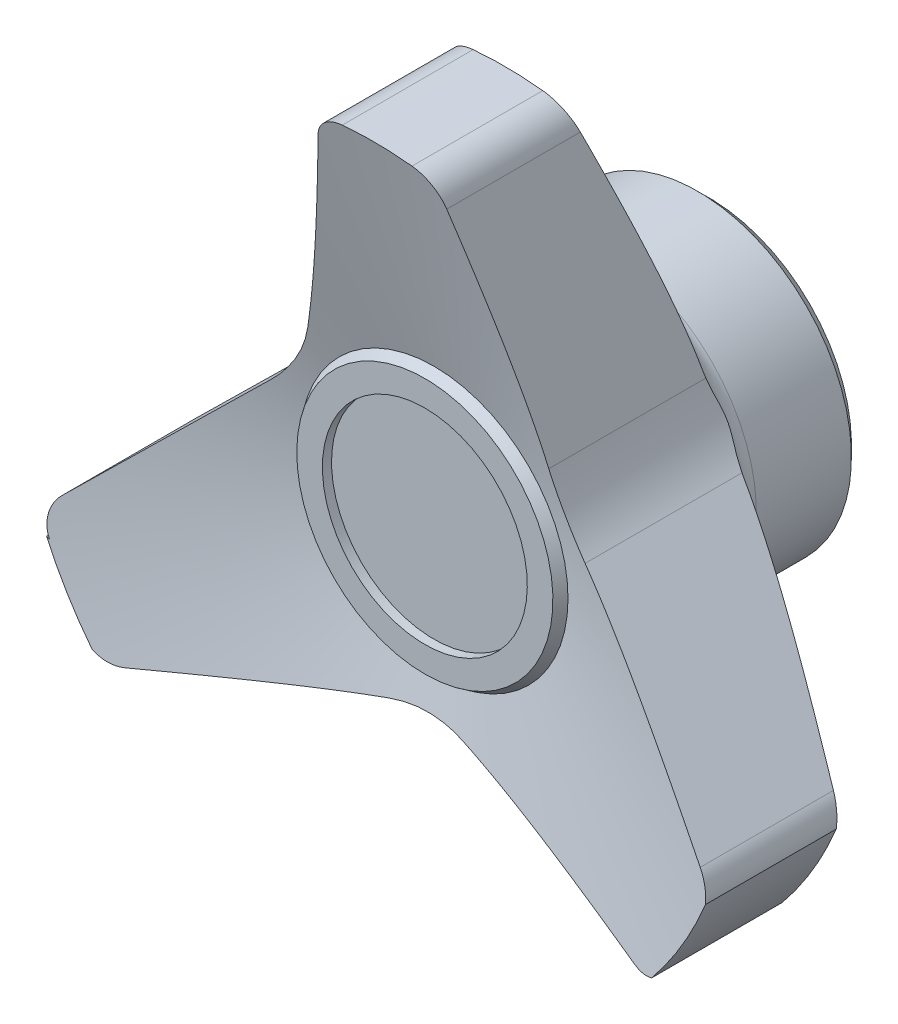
ISO-10303-21;
HEADER;
FILE_DESCRIPTION(('STEP AP214'),'2;1');
FILE_NAME('part.step','',(''),(''),'','','');
FILE_SCHEMA(('AUTOMOTIVE_DESIGN { 1 0 10303 214 1 1 1 1 }'));
ENDSEC;
DATA;
#1=APPLICATION_CONTEXT('core data for automotive mechanical design processes');
#2=APPLICATION_PROTOCOL_DEFINITION('international standard','automotive_design',2000,#1);
#3=PRODUCT_CONTEXT('',#1,'mechanical');
#4=PRODUCT('Part','Part','',(#3));
#5=PRODUCT_RELATED_PRODUCT_CATEGORY('part','',(#4));
#6=PRODUCT_DEFINITION_FORMATION('','',#4);
#7=PRODUCT_DEFINITION_CONTEXT('part definition',#1,'design');
#8=PRODUCT_DEFINITION('design','',#6,#7);
#9=PRODUCT_DEFINITION_SHAPE('','',#8);
#10=(LENGTH_UNIT() NAMED_UNIT(*) SI_UNIT(.MILLI.,.METRE.));
#11=(NAMED_UNIT(*) PLANE_ANGLE_UNIT() SI_UNIT($,.RADIAN.));
#12=(NAMED_UNIT(*) SI_UNIT($,.STERADIAN.) SOLID_ANGLE_UNIT());
#13=UNCERTAINTY_MEASURE_WITH_UNIT(LENGTH_MEASURE(1.E-05),#10,'distance_accuracy_value','');
#14=(GEOMETRIC_REPRESENTATION_CONTEXT(3) GLOBAL_UNCERTAINTY_ASSIGNED_CONTEXT((#13)) GLOBAL_UNIT_ASSIGNED_CONTEXT((#10,
#11,#12)) REPRESENTATION_CONTEXT('',''));
#15=CARTESIAN_POINT('',(0.,0.,0.));
#16=DIRECTION('',(0.,0.,1.));
#17=DIRECTION('',(1.,0.,0.));
#18=AXIS2_PLACEMENT_3D('',#15,#16,#17);
#19=CARTESIAN_POINT('',(0.,0.,11.2321128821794));
#20=DIRECTION('',(0.,0.,1.));
#21=DIRECTION('',(-0.708817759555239,-0.705391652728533,0.));
#22=AXIS2_PLACEMENT_3D('',#19,#20,#21);
#23=CONICAL_SURFACE('',#22,14.750786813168,1.18682389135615);
#24=CARTESIAN_POINT('',(-24.7629656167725,-19.4698926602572,17.9994342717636));
#25=CARTESIAN_POINT('',(-24.6939388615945,-19.5171671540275,17.9893152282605));
#26=CARTESIAN_POINT('',(-24.6230542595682,-19.5614472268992,17.977982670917));
#27=CARTESIAN_POINT('',(-24.4781800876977,-19.6437902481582,17.9530005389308));
#28=CARTESIAN_POINT('',(-24.4041915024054,-19.6818551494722,17.9393516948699));
#29=CARTESIAN_POINT('',(-24.2539267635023,-19.7514533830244,17.9098896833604));
#30=CARTESIAN_POINT('',(-24.1776590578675,-19.7830080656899,17.8940838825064));
#31=CARTESIAN_POINT('',(-24.0232118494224,-19.8396144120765,17.8604025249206));
#32=CARTESIAN_POINT('',(-23.9450322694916,-19.8646658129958,17.8425268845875));
#33=CARTESIAN_POINT('',(-23.7086138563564,-19.9298945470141,17.7860147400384));
#34=CARTESIAN_POINT('',(-23.5482552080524,-19.9602566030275,17.7444458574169));
#35=CARTESIAN_POINT('',(-23.2265843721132,-19.9947042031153,17.6546653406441));
#36=CARTESIAN_POINT('',(-23.0652717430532,-19.9987764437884,17.6064503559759));
#37=CARTESIAN_POINT('',(-22.797289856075,-19.984243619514,17.5210144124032));
#38=CARTESIAN_POINT('',(-22.6897307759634,-19.972510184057,17.4852442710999));
#39=CARTESIAN_POINT('',(-22.4774517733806,-19.9377646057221,17.41167897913));
#40=CARTESIAN_POINT('',(-22.3727256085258,-19.9147798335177,17.3738889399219));
#41=CARTESIAN_POINT('',(-22.269812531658,-19.8863594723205,17.3352256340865));
#42=B_SPLINE_CURVE_WITH_KNOTS('',3,(#24,#25,#26,#27,#28,#29,#30,#31,#32,#33,#34,#35,#36,#37,#38,
#39,#40,#41),.UNSPECIFIED.,.F.,.F.,(4,2,2,2,2,2,2,2,4),(0.,0.25271896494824,0.505358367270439,
0.757155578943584,1.00896296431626,1.51178263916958,2.01485673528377,2.35614757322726,
2.69661226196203),.UNSPECIFIED.);
#43=CARTESIAN_POINT('',(-24.7616024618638,-19.4708254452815,17.9992342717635));
#44=VERTEX_POINT('',#43);
#45=CARTESIAN_POINT('',(-22.270033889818,-19.8864205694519,17.3353087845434));
#46=VERTEX_POINT('',#45);
#47=EDGE_CURVE('E673',#44,#46,#42,.T.);
#48=ORIENTED_EDGE('',*,*,#47,.F.);
#49=CARTESIAN_POINT('',(0.,0.,17.9992342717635));
#50=DIRECTION('',(0.,0.,1.));
#51=DIRECTION('',(-0.708817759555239,-0.705391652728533,0.));
#52=AXIS2_PLACEMENT_3D('',#49,#50,#51);
#53=CIRCLE('',#52,31.5);
#54=CARTESIAN_POINT('',(-28.7412431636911,-12.891506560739,17.9992342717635));
#55=VERTEX_POINT('',#54);
#56=EDGE_CURVE('E497',#55,#44,#53,.T.);
#57=ORIENTED_EDGE('',*,*,#56,.F.);
#58=CARTESIAN_POINT('',(-41.2665460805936,7.61081032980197,22.226362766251));
#59=CARTESIAN_POINT('',(-41.2444692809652,7.25117936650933,22.1912373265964));
#60=CARTESIAN_POINT('',(-41.2148277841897,6.89217426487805,22.1549189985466));
#61=CARTESIAN_POINT('',(-41.1405017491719,6.17597850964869,22.0799117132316));
#62=CARTESIAN_POINT('',(-41.0958174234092,5.81878783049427,22.0412227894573));
#63=CARTESIAN_POINT('',(-40.9393806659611,4.75112249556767,21.9216611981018));
#64=CARTESIAN_POINT('',(-40.8052221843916,4.0441935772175,21.8372585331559));
#65=CARTESIAN_POINT('',(-40.4786382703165,2.64624918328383,21.659427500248));
#66=CARTESIAN_POINT('',(-40.2862954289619,1.95521263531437,21.566012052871));
#67=CARTESIAN_POINT('',(-39.844907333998,0.592672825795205,21.3702733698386));
#68=CARTESIAN_POINT('',(-39.5958519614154,-0.0788269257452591,21.2679485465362));
#69=CARTESIAN_POINT('',(-38.9856589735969,-1.53450927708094,21.0325009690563));
#70=CARTESIAN_POINT('',(-38.6119871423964,-2.31315099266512,20.8973940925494));
#71=CARTESIAN_POINT('',(-37.7892219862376,-3.82733186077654,20.6150514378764));
#72=CARTESIAN_POINT('',(-37.3401121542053,-4.5628615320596,20.4678130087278));
#73=CARTESIAN_POINT('',(-36.3712783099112,-5.98401442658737,20.1616481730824));
#74=CARTESIAN_POINT('',(-35.8515040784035,-6.66960162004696,20.0027134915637));
#75=CARTESIAN_POINT('',(-34.7474310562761,-7.98360768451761,19.6738399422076));
#76=CARTESIAN_POINT('',(-34.1631453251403,-8.61203807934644,19.5039033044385));
#77=CARTESIAN_POINT('',(-33.0320324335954,-9.712873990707,19.1809297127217));
#78=CARTESIAN_POINT('',(-32.4935512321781,-10.1943340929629,19.0293845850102));
#79=CARTESIAN_POINT('',(-31.3792544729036,-11.1092642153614,18.7192667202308));
#80=CARTESIAN_POINT('',(-30.8034434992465,-11.542740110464,18.560694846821));
#81=CARTESIAN_POINT('',(-29.6191402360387,-12.3586932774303,18.2370204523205));
#82=CARTESIAN_POINT('',(-29.010675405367,-12.7412124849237,18.0719234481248));
#83=CARTESIAN_POINT('',(-28.0766547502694,-13.2752106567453,17.8196463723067));
#84=CARTESIAN_POINT('',(-27.7617098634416,-13.4466035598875,17.7347684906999));
#85=CARTESIAN_POINT('',(-27.1252446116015,-13.7758962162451,17.5635126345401));
#86=CARTESIAN_POINT('',(-26.803724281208,-13.9337960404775,17.4771346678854));
#87=CARTESIAN_POINT('',(-26.4791667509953,-14.0848471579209,17.390024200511));
#88=B_SPLINE_CURVE_WITH_KNOTS('',3,(#58,#59,#60,#61,#62,#63,#64,#65,#66,#67,#68,#69,#70,#71,#72,
#73,#74,#75,#76,#77,#78,#79,#80,#81,#82,#83,#84,#85,#86,#87),.UNSPECIFIED.,.F.,.F.,(4,2,2,2,2,2,
2,2,2,2,2,2,2,2,4),(0.,1.08587796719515,2.17174059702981,4.34237931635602,6.50995121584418,
8.67791016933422,11.2958552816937,13.9143739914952,16.5347634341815,19.1546233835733,
21.3663225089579,23.577750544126,25.7873472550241,26.8924902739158,27.997627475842),.UNSPECIFIED.);
#89=CARTESIAN_POINT('',(-28.5362030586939,-13.0118229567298,17.9437838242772));
#90=VERTEX_POINT('',#89);
#91=EDGE_CURVE('E297',#55,#90,#88,.T.);
#92=ORIENTED_EDGE('',*,*,#91,.T.);
#93=CARTESIAN_POINT('',(-27.8995738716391,-9.62393672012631,17.1963603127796));
#94=CARTESIAN_POINT('',(-27.9602548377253,-9.68312565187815,17.2273355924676));
#95=CARTESIAN_POINT('',(-28.0185598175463,-9.74503225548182,17.2577871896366));
#96=CARTESIAN_POINT('',(-28.1299801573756,-9.87393183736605,17.3174625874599));
#97=CARTESIAN_POINT('',(-28.1830941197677,-9.94092617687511,17.3466860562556));
#98=CARTESIAN_POINT('',(-28.2837748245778,-10.0797760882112,17.4037720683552));
#99=CARTESIAN_POINT('',(-28.3313288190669,-10.1516422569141,17.4316314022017));
#100=CARTESIAN_POINT('',(-28.4202965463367,-10.2996224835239,17.4857173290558));
#101=CARTESIAN_POINT('',(-28.4617108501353,-10.3757361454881,17.5119440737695));
#102=CARTESIAN_POINT('',(-28.5762568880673,-10.6100904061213,17.5879997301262));
#103=CARTESIAN_POINT('',(-28.6395794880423,-10.7741902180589,17.6351406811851));
#104=CARTESIAN_POINT('',(-28.7367980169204,-11.1127948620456,17.7205995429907));
#105=CARTESIAN_POINT('',(-28.7707267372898,-11.2872878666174,17.7589272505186));
#106=CARTESIAN_POINT('',(-28.806233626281,-11.6327318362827,17.8238920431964));
#107=CARTESIAN_POINT('',(-28.8093381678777,-11.8034267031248,17.8510161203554));
#108=CARTESIAN_POINT('',(-28.7921053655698,-12.058724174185,17.8841861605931));
#109=CARTESIAN_POINT('',(-28.7827094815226,-12.1437131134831,17.8939911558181));
#110=CARTESIAN_POINT('',(-28.7566450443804,-12.3128216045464,17.9110262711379));
#111=CARTESIAN_POINT('',(-28.7399791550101,-12.3969414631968,17.9182573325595));
#112=CARTESIAN_POINT('',(-28.697538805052,-12.5714438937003,17.9306304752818));
#113=CARTESIAN_POINT('',(-28.6710562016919,-12.66167315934,17.9355127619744));
#114=CARTESIAN_POINT('',(-28.6097628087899,-12.8392160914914,17.9420623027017));
#115=CARTESIAN_POINT('',(-28.5749652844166,-12.9265341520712,17.9437346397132));
#116=CARTESIAN_POINT('',(-28.5361148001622,-13.012017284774,17.9437839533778));
#117=B_SPLINE_CURVE_WITH_KNOTS('',3,(#93,#94,#95,#96,#97,#98,#99,#100,#101,#102,#103,#104,#105,
#106,#107,#108,#109,#110,#111,#112,#113,#114,#115,#116),.UNSPECIFIED.,.F.,.F.,(4,2,2,2,2,2,2,2,
2,2,2,4),(0.,0.270681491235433,0.541435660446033,0.812798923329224,1.0841369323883,
1.62740786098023,2.17007193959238,2.6857214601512,2.94363109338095,3.20144630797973,
3.48346151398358,3.76502977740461),.UNSPECIFIED.);
#118=CARTESIAN_POINT('',(-27.8997170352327,-9.62407639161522,17.1964333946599));
#119=VERTEX_POINT('',#118);
#120=EDGE_CURVE('E260',#119,#90,#117,.T.);
#121=ORIENTED_EDGE('',*,*,#120,.F.);
#122=CARTESIAN_POINT('',(-27.8998601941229,-9.62421606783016,17.1965064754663));
#123=CARTESIAN_POINT('',(-27.6205554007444,-9.35170601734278,17.0539272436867));
#124=CARTESIAN_POINT('',(-27.3411204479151,-9.07906897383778,16.9118457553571));
#125=CARTESIAN_POINT('',(-26.7819574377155,-8.53350891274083,16.628809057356));
#126=CARTESIAN_POINT('',(-26.5022293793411,-8.26058589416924,16.4878538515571));
#127=CARTESIAN_POINT('',(-25.662567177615,-7.44135044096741,16.0668792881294));
#128=CARTESIAN_POINT('',(-25.1021470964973,-6.89456389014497,15.7887469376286));
#129=CARTESIAN_POINT('',(-23.9802789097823,-5.79998777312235,15.239187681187));
#130=CARTESIAN_POINT('',(-23.4188324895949,-5.25219985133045,14.9677540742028));
#131=CARTESIAN_POINT('',(-22.2938822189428,-4.15461662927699,14.4331894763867));
#132=CARTESIAN_POINT('',(-21.73037826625,-3.60482122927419,14.1700589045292));
#133=CARTESIAN_POINT('',(-20.6002017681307,-2.50213891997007,13.6544870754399));
#134=CARTESIAN_POINT('',(-20.0335265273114,-1.9492493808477,13.4020572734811));
#135=CARTESIAN_POINT('',(-19.1810961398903,-1.11755635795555,13.0345307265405));
#136=CARTESIAN_POINT('',(-18.8965669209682,-0.839948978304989,12.9138818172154));
#137=CARTESIAN_POINT('',(-18.3265869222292,-0.283835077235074,12.6769171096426));
#138=CARTESIAN_POINT('',(-18.0411361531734,-0.00532856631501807,12.5606012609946));
#139=CARTESIAN_POINT('',(-17.468889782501,0.552996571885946,12.3329030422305));
#140=CARTESIAN_POINT('',(-17.1820930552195,0.832816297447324,12.2215261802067));
#141=CARTESIAN_POINT('',(-16.6073583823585,1.3935692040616,12.0047171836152));
#142=CARTESIAN_POINT('',(-16.3194204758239,1.67450234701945,11.899284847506));
#143=CARTESIAN_POINT('',(-15.7421429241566,2.23773627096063,11.6953250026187));
#144=CARTESIAN_POINT('',(-15.4528026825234,2.52003763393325,11.5968007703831));
#145=CARTESIAN_POINT('',(-14.8727260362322,3.08600255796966,11.4079208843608));
#146=CARTESIAN_POINT('',(-14.5819894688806,3.36966627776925,11.3175662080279));
#147=CARTESIAN_POINT('',(-14.2905247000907,3.6540404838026,11.2319128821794));
#148=B_SPLINE_CURVE_WITH_KNOTS('',3,(#122,#123,#124,#125,#126,#127,#128,#129,#130,#131,#132,
#133,#134,#135,#136,#137,#138,#139,#140,#141,#142,#143,#144,#145,#146,#147),.UNSPECIFIED.,.F.,
.F.,(4,2,2,2,2,2,2,2,2,2,2,2,4),(0.,1.24636034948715,2.49272498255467,4.98541893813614,
7.47550901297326,9.96572453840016,12.4585418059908,13.7048007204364,14.9510451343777,
16.1986461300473,17.4462048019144,18.6943512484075,19.9426468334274),.UNSPECIFIED.);
#149=CARTESIAN_POINT('',(-14.2912054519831,3.65337629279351,11.2321128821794));
#150=VERTEX_POINT('',#149);
#151=EDGE_CURVE('E269',#119,#150,#148,.T.);
#152=ORIENTED_EDGE('',*,*,#151,.T.);
#153=CARTESIAN_POINT('',(0.,0.,11.2321128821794));
#154=DIRECTION('',(0.,0.,1.));
#155=DIRECTION('',(-0.708817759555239,-0.705391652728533,0.));
#156=AXIS2_PLACEMENT_3D('',#153,#154,#155);
#157=CIRCLE('',#156,14.750786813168);
#158=CARTESIAN_POINT('',(-2.72283045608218,-14.4973068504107,11.2321128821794));
#159=VERTEX_POINT('',#158);
#160=EDGE_CURVE('E499',#150,#159,#157,.T.);
#161=ORIENTED_EDGE('',*,*,#160,.T.);
#162=CARTESIAN_POINT('',(-2.72166590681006,-14.4970218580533,11.2319128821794));
#163=CARTESIAN_POINT('',(-2.77873827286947,-14.5109872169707,11.24171623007));
#164=CARTESIAN_POINT('',(-2.835657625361,-14.5253571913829,11.2517817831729));
#165=CARTESIAN_POINT('',(-2.94919029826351,-14.5549063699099,11.2724372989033));
#166=CARTESIAN_POINT('',(-3.00580361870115,-14.5700855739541,11.2830272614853));
#167=CARTESIAN_POINT('',(-3.06226392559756,-14.5856693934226,11.2938794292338));
#168=B_SPLINE_CURVE_WITH_KNOTS('',3,(#162,#163,#164,#165,#166,#167),.UNSPECIFIED.,.F.,.F.,(4,2,
4),(0.,0.178685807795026,0.357371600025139),.UNSPECIFIED.);
#169=CARTESIAN_POINT('',(-3.06204256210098,-14.5856083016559,11.2938368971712));
#170=VERTEX_POINT('',#169);
#171=EDGE_CURVE('E314',#159,#170,#168,.T.);
#172=ORIENTED_EDGE('',*,*,#171,.T.);
#173=CARTESIAN_POINT('',(-22.2702552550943,-19.8864816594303,17.3353919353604));
#174=CARTESIAN_POINT('',(-21.87669885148,-19.7778722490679,17.1875643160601));
#175=CARTESIAN_POINT('',(-21.4829389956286,-19.6692066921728,17.0403196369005));
#176=CARTESIAN_POINT('',(-20.6949596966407,-19.4517487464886,16.7471541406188));
#177=CARTESIAN_POINT('',(-20.3007402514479,-19.3429563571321,16.6012333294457));
#178=CARTESIAN_POINT('',(-19.1173336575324,-19.0163726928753,16.1657011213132));
#179=CARTESIAN_POINT('',(-18.3273834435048,-18.7983708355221,15.8783143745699));
#180=CARTESIAN_POINT('',(-16.7460327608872,-18.3619668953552,15.3115511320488));
#181=CARTESIAN_POINT('',(-15.9546358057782,-18.1435657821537,15.0321641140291));
#182=CARTESIAN_POINT('',(-14.3685856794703,-17.7058649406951,14.4833053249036));
#183=CARTESIAN_POINT('',(-13.5739322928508,-17.4865651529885,14.2138342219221));
#184=CARTESIAN_POINT('',(-11.9794386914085,-17.0465341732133,13.6877047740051));
#185=CARTESIAN_POINT('',(-11.1795927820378,-16.8258014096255,13.4310648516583));
#186=CARTESIAN_POINT('',(-9.97603370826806,-16.493656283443,13.0595690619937));
#187=CARTESIAN_POINT('',(-9.5742480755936,-16.3827758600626,12.9379903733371));
#188=CARTESIAN_POINT('',(-8.76923576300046,-16.1606173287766,12.7000898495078));
#189=CARTESIAN_POINT('',(-8.36600910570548,-16.0493392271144,12.5837679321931));
#190=CARTESIAN_POINT('',(-7.55737015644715,-15.8261798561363,12.3571027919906));
#191=CARTESIAN_POINT('',(-7.15195555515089,-15.7142979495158,12.2467684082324));
#192=CARTESIAN_POINT('',(-6.33937758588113,-15.4900515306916,12.0333203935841));
#193=CARTESIAN_POINT('',(-5.93221429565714,-15.3776870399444,11.9302064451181));
#194=CARTESIAN_POINT('',(-5.11571921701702,-15.1523596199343,11.7323439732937));
#195=CARTESIAN_POINT('',(-4.70638622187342,-15.0393963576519,11.6376007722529));
#196=CARTESIAN_POINT('',(-3.88565707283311,-14.8129004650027,11.4579560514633));
#197=CARTESIAN_POINT('',(-3.47426060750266,-14.6993677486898,11.3730560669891));
#198=CARTESIAN_POINT('',(-3.06182119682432,-14.5855472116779,11.293794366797));
#199=B_SPLINE_CURVE_WITH_KNOTS('',3,(#173,#174,#175,#176,#177,#178,#179,#180,#181,#182,#183,
#184,#185,#186,#187,#188,#189,#190,#191,#192,#193,#194,#195,#196,#197,#198),.UNSPECIFIED.,.F.,
.F.,(4,2,2,2,2,2,2,2,2,2,2,2,4),(0.,1.30261999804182,2.60524584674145,5.21044852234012,
7.81205046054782,10.4138273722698,13.0192384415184,14.3217347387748,15.6242106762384,
16.9285598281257,18.2328515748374,19.5379667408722,20.8432851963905),.UNSPECIFIED.);
#200=EDGE_CURVE('E320',#46,#170,#199,.T.);
#201=ORIENTED_EDGE('',*,*,#200,.F.);
#202=EDGE_LOOP('',(#48,#57,#92,#121,#152,#161,#172,#201));
#203=FACE_BOUND('',#202,.T.);
#204=ADVANCED_FACE('F14',(#203),#23,.T.);
#205=CARTESIAN_POINT('',(0.,0.,30.));
#206=DIRECTION('',(0.,0.,1.));
#207=DIRECTION('',(-0.708817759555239,-0.705391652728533,0.));
#208=AXIS2_PLACEMENT_3D('',#205,#206,#207);
#209=CYLINDRICAL_SURFACE('',#208,31.5);
#210=ORIENTED_EDGE('',*,*,#56,.T.);
#211=DIRECTION('',(0.,0.,1.));
#212=VECTOR('',#211,1.);
#213=CARTESIAN_POINT('',(-24.7616024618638,-19.4708254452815,23.7420299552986));
#214=LINE('',#213,#212);
#215=CARTESIAN_POINT('',(-24.7616024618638,-19.4708254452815,29.4848256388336));
#216=VERTEX_POINT('',#215);
#217=EDGE_CURVE('E327',#44,#216,#214,.T.);
#218=ORIENTED_EDGE('',*,*,#217,.T.);
#219=CARTESIAN_POINT('',(0.,0.,29.4848256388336));
#220=DIRECTION('',(0.,0.,1.));
#221=DIRECTION('',(-0.708817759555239,-0.705391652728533,0.));
#222=AXIS2_PLACEMENT_3D('',#219,#220,#221);
#223=CIRCLE('',#222,31.5);
#224=CARTESIAN_POINT('',(-28.7412431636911,-12.891506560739,29.4848256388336));
#225=VERTEX_POINT('',#224);
#226=EDGE_CURVE('E508',#225,#216,#223,.T.);
#227=ORIENTED_EDGE('',*,*,#226,.F.);
#228=DIRECTION('',(0.,0.,1.));
#229=VECTOR('',#228,1.);
#230=CARTESIAN_POINT('',(-28.7412431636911,-12.891506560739,15.));
#231=LINE('',#230,#229);
#232=EDGE_CURVE('E488',#55,#225,#231,.T.);
#233=ORIENTED_EDGE('',*,*,#232,.F.);
#234=EDGE_LOOP('',(#210,#218,#227,#233));
#235=FACE_BOUND('',#234,.T.);
#236=ADVANCED_FACE('F212',(#235),#209,.T.);
#237=CARTESIAN_POINT('',(24.3958554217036,-19.9271733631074,29.4848256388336));
#238=VERTEX_POINT('',#237);
#239=CARTESIAN_POINT('',(29.1371539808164,-11.9698060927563,29.4848256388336));
#240=VERTEX_POINT('',#239);
#241=EDGE_CURVE('E509',#238,#240,#223,.T.);
#242=ORIENTED_EDGE('',*,*,#241,.F.);
#243=DIRECTION('',(0.,0.,1.));
#244=VECTOR('',#243,1.);
#245=CARTESIAN_POINT('',(24.3958554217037,-19.9271733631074,23.7420299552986));
#246=LINE('',#245,#244);
#247=CARTESIAN_POINT('',(24.3958554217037,-19.9271733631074,17.9992342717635));
#248=VERTEX_POINT('',#247);
#249=EDGE_CURVE('E35',#238,#248,#246,.F.);
#250=ORIENTED_EDGE('',*,*,#249,.T.);
#251=CARTESIAN_POINT('',(29.1371539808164,-11.9698060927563,17.9992342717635));
#252=VERTEX_POINT('',#251);
#253=EDGE_CURVE('E188',#248,#252,#53,.T.);
#254=ORIENTED_EDGE('',*,*,#253,.T.);
#255=DIRECTION('',(0.,0.,1.));
#256=VECTOR('',#255,1.);
#257=CARTESIAN_POINT('',(29.1371539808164,-11.9698060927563,23.7420299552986));
#258=LINE('',#257,#256);
#259=EDGE_CURVE('E546',#252,#240,#258,.T.);
#260=ORIENTED_EDGE('',*,*,#259,.T.);
#261=EDGE_LOOP('',(#242,#250,#254,#260));
#262=FACE_BOUND('',#261,.T.);
#263=ADVANCED_FACE('F353',(#262),#209,.T.);
#264=CARTESIAN_POINT('',(0.,0.,29.4848256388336));
#265=DIRECTION('',(0.,0.,1.));
#266=DIRECTION('',(-0.708817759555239,-0.705391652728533,0.));
#267=AXIS2_PLACEMENT_3D('',#264,#265,#266);
#268=CONICAL_SURFACE('',#267,31.5,1.30899693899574);
#269=CARTESIAN_POINT('',(0.,0.,24.2));
#270=DIRECTION('',(0.,0.,1.));
#271=DIRECTION('',(-0.708817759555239,-0.705391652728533,0.));
#272=AXIS2_PLACEMENT_3D('',#269,#270,#271);
#273=CIRCLE('',#272,11.7767622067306);
#274=CARTESIAN_POINT('',(-8.3475782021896,-8.30722975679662,24.2));
#275=VERTEX_POINT('',#274);
#276=EDGE_CURVE('E515',#275,#275,#273,.T.);
#277=ORIENTED_EDGE('',*,*,#276,.F.);
#278=EDGE_LOOP('',(#277));
#279=FACE_BOUND('',#278,.T.);
#280=CARTESIAN_POINT('',(-22.269812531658,-19.8863594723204,29.0444567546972));
#281=CARTESIAN_POINT('',(-22.3510874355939,-19.9088030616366,29.0647063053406));
#282=CARTESIAN_POINT('',(-22.4334015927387,-19.9278307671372,29.084572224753));
#283=CARTESIAN_POINT('',(-22.5995522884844,-19.958908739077,29.1234203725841));
#284=CARTESIAN_POINT('',(-22.6833890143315,-19.9709581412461,29.1424024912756));
#285=CARTESIAN_POINT('',(-22.8521118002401,-19.9879386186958,29.1793842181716));
#286=CARTESIAN_POINT('',(-22.9369990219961,-19.9928609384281,29.1973825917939));
#287=CARTESIAN_POINT('',(-23.1070871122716,-19.9954758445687,29.2322515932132));
#288=CARTESIAN_POINT('',(-23.1922879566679,-19.9931689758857,29.249122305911));
#289=CARTESIAN_POINT('',(-23.4477176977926,-19.9752935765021,29.297928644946));
#290=CARTESIAN_POINT('',(-23.6176650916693,-19.9487592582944,29.3280346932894));
#291=CARTESIAN_POINT('',(-23.9510634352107,-19.8667685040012,29.3824386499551));
#292=CARTESIAN_POINT('',(-24.1145263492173,-19.8113682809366,29.4067477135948));
#293=CARTESIAN_POINT('',(-24.3580385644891,-19.7046651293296,29.4393256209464));
#294=CARTESIAN_POINT('',(-24.4421275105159,-19.6630185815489,29.4498534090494));
#295=CARTESIAN_POINT('',(-24.6061611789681,-19.5719610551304,29.4689347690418));
#296=CARTESIAN_POINT('',(-24.6861082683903,-19.5225545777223,29.4774894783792));
#297=CARTESIAN_POINT('',(-24.7636585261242,-19.4694180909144,29.4850256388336));
#298=B_SPLINE_CURVE_WITH_KNOTS('',3,(#280,#281,#282,#283,#284,#285,#286,#287,#288,#289,#290,
#291,#292,#293,#294,#295,#296,#297),.UNSPECIFIED.,.F.,.F.,(4,2,2,2,2,2,2,2,4),(0.,
0.260068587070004,0.520169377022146,0.780589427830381,1.04098984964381,1.56212185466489,
2.0822427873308,2.36513204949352,2.64785782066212),.UNSPECIFIED.);
#299=CARTESIAN_POINT('',(-22.270033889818,-19.8864205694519,29.0445118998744));
#300=VERTEX_POINT('',#299);
#301=EDGE_CURVE('E9',#300,#216,#298,.T.);
#302=ORIENTED_EDGE('',*,*,#301,.F.);
#303=CARTESIAN_POINT('',(-3.06182119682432,-14.5855472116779,25.0377944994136));
#304=CARTESIAN_POINT('',(-3.36507952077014,-14.669237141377,25.0764362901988));
#305=CARTESIAN_POINT('',(-3.66808607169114,-14.7528575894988,25.1171508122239));
#306=CARTESIAN_POINT('',(-4.27359688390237,-14.9199598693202,25.2023504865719));
#307=CARTESIAN_POINT('',(-4.57610116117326,-15.00344170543,25.2468355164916));
#308=CARTESIAN_POINT('',(-5.48278868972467,-15.253659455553,25.3853723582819));
#309=CARTESIAN_POINT('',(-6.08625024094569,-15.4201962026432,25.4845193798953));
#310=CARTESIAN_POINT('',(-7.29109500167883,-15.7526961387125,25.6937072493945));
#311=CARTESIAN_POINT('',(-7.89247907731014,-15.9186595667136,25.8037427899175));
#312=CARTESIAN_POINT('',(-9.09371741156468,-16.2501642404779,26.0325842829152));
#313=CARTESIAN_POINT('',(-9.69357159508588,-16.4157054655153,26.15139065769));
#314=CARTESIAN_POINT('',(-10.8914718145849,-16.7462889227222,26.3959337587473));
#315=CARTESIAN_POINT('',(-11.4895188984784,-16.911331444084,26.5216649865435));
#316=CARTESIAN_POINT('',(-12.6844846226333,-17.241105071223,26.7787761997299));
#317=CARTESIAN_POINT('',(-13.2814032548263,-17.4058361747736,26.9101562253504));
#318=CARTESIAN_POINT('',(-14.4743499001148,-17.7350525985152,27.1775071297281));
#319=CARTESIAN_POINT('',(-15.0703778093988,-17.8995378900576,27.3134785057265));
#320=CARTESIAN_POINT('',(-16.2616297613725,-18.2282866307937,27.5891578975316));
#321=CARTESIAN_POINT('',(-16.8568538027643,-18.3925500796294,27.728865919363));
#322=CARTESIAN_POINT('',(-17.8537802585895,-18.6676709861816,27.9655723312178));
#323=CARTESIAN_POINT('',(-18.2556675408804,-18.7785794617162,28.0617347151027));
#324=CARTESIAN_POINT('',(-19.0591484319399,-19.0003153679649,28.2552962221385));
#325=CARTESIAN_POINT('',(-19.4607420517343,-19.1111428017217,28.3526952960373));
#326=CARTESIAN_POINT('',(-20.2637761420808,-19.3327554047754,28.5486118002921));
#327=CARTESIAN_POINT('',(-20.665216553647,-19.4435405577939,28.6471294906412));
#328=CARTESIAN_POINT('',(-21.4678895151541,-19.6650535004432,28.8451444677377));
#329=CARTESIAN_POINT('',(-21.8691220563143,-19.7757812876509,28.944641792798));
#330=CARTESIAN_POINT('',(-22.2702552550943,-19.8864816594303,29.0445670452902));
#331=B_SPLINE_CURVE_WITH_KNOTS('',3,(#303,#304,#305,#306,#307,#308,#309,#310,#311,#312,#313,
#314,#315,#316,#317,#318,#319,#320,#321,#322,#323,#324,#325,#326,#327,#328,#329,#330),
.UNSPECIFIED.,.F.,.F.,(4,2,2,2,2,2,2,2,2,2,2,2,2,4),(0.,0.950858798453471,1.90168674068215,
3.80301775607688,5.70342653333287,7.60392687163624,9.50293933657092,11.4019653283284,
13.3011976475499,15.2004330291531,16.4840010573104,17.7675181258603,19.0513398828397,
20.3352120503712),.UNSPECIFIED.);
#332=CARTESIAN_POINT('',(-3.06204256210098,-14.5856083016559,25.0378227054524));
#333=VERTEX_POINT('',#332);
#334=EDGE_CURVE('E28',#333,#300,#331,.T.);
#335=ORIENTED_EDGE('',*,*,#334,.F.);
#336=CARTESIAN_POINT('',(-3.06226392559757,-14.5856693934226,25.0378509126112));
#337=CARTESIAN_POINT('',(-2.90595993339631,-14.5425311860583,25.0179323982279));
#338=CARTESIAN_POINT('',(-2.74864335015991,-14.5025235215,24.9993412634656));
#339=CARTESIAN_POINT('',(-2.43221836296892,-14.4288632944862,24.9649678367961));
#340=CARTESIAN_POINT('',(-2.27310987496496,-14.3952110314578,24.9491856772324));
#341=CARTESIAN_POINT('',(-1.79343418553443,-14.303927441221,24.9062833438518));
#342=CARTESIAN_POINT('',(-1.4705507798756,-14.2559787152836,24.8836117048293));
#343=CARTESIAN_POINT('',(-0.82980897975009,-14.1874417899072,24.8515158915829));
#344=CARTESIAN_POINT('',(-0.512038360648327,-14.166174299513,24.8417624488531));
#345=CARTESIAN_POINT('',(0.124237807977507,-14.1489882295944,24.8348261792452));
#346=CARTESIAN_POINT('',(0.442742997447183,-14.1530591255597,24.8376381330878));
#347=CARTESIAN_POINT('',(0.980349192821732,-14.1813217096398,24.8529144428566));
#348=CARTESIAN_POINT('',(1.19991838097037,-14.1989455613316,24.8621469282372));
#349=CARTESIAN_POINT('',(1.6374396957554,-14.2461960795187,24.8863818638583));
#350=CARTESIAN_POINT('',(1.85539191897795,-14.2758220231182,24.9013839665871));
#351=CARTESIAN_POINT('',(2.29290533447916,-14.3475686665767,24.9372094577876));
#352=CARTESIAN_POINT('',(2.51242178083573,-14.3899102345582,24.9581353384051));
#353=CARTESIAN_POINT('',(2.94822042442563,-14.4866277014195,25.005292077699));
#354=CARTESIAN_POINT('',(3.1645025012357,-14.5410040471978,25.0315231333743));
#355=CARTESIAN_POINT('',(3.37878591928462,-14.6012736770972,25.060209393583));
#356=B_SPLINE_CURVE_WITH_KNOTS('',3,(#336,#337,#338,#339,#340,#341,#342,#343,#344,#345,#346,
#347,#348,#349,#350,#351,#352,#353,#354,#355),.UNSPECIFIED.,.F.,.F.,(4,2,2,2,2,2,2,2,2,4),(0.,
0.49001938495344,0.980061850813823,1.9602531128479,2.91494637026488,3.86924311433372,
4.53027228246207,5.19126164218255,5.86447087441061,6.53770510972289),.UNSPECIFIED.);
#357=CARTESIAN_POINT('',(3.37856485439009,-14.6012115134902,25.0601798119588));
#358=VERTEX_POINT('',#357);
#359=EDGE_CURVE('E343',#333,#358,#356,.T.);
#360=ORIENTED_EDGE('',*,*,#359,.T.);
#361=CARTESIAN_POINT('',(3.37834378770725,-14.6011493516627,25.060150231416));
#362=CARTESIAN_POINT('',(3.68258042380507,-14.6866977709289,25.1008613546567));
#363=CARTESIAN_POINT('',(3.98656040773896,-14.7721740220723,25.1435928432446));
#364=CARTESIAN_POINT('',(4.59401329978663,-14.9429839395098,25.2327197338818));
#365=CARTESIAN_POINT('',(4.89748622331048,-15.0283176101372,25.2791150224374));
#366=CARTESIAN_POINT('',(5.80708526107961,-15.2840881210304,25.4232200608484));
#367=CARTESIAN_POINT('',(6.41248867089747,-15.4543217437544,25.5258622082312));
#368=CARTESIAN_POINT('',(7.621263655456,-15.7942176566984,25.7416380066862));
#369=CARTESIAN_POINT('',(8.2246360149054,-15.963880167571,25.8547669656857));
#370=CARTESIAN_POINT('',(9.42988319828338,-16.3027840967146,26.0894432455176));
#371=CARTESIAN_POINT('',(10.0317579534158,-16.4720254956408,26.2109909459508));
#372=CARTESIAN_POINT('',(11.2337761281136,-16.8100214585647,26.4607267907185));
#373=CARTESIAN_POINT('',(11.8339204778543,-16.9787762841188,26.588910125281));
#374=CARTESIAN_POINT('',(13.0331166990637,-17.3159787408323,26.8506814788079));
#375=CARTESIAN_POINT('',(13.6321685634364,-17.4844263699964,26.9842695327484));
#376=CARTESIAN_POINT('',(14.8294096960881,-17.82107907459,27.2558352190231));
#377=CARTESIAN_POINT('',(15.4275988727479,-17.9892841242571,27.3938132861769));
#378=CARTESIAN_POINT('',(16.6232029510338,-18.3254765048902,27.6733419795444));
#379=CARTESIAN_POINT('',(17.2206178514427,-18.493463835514,27.8148926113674));
#380=CARTESIAN_POINT('',(18.2134340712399,-18.7726342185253,28.0527049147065));
#381=CARTESIAN_POINT('',(18.6090189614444,-18.8838688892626,28.1481414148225));
#382=CARTESIAN_POINT('',(19.3999171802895,-19.1062618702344,28.3401549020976));
#383=CARTESIAN_POINT('',(19.7952305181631,-19.2174201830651,28.4367318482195));
#384=CARTESIAN_POINT('',(20.5857103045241,-19.4396955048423,28.6309186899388));
#385=CARTESIAN_POINT('',(20.9808767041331,-19.5508125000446,28.7285288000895));
#386=CARTESIAN_POINT('',(21.7710156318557,-19.7729919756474,28.9246565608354));
#387=CARTESIAN_POINT('',(22.1659881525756,-19.8840544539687,29.0231742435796));
#388=CARTESIAN_POINT('',(22.5608681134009,-19.9950909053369,29.1220896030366));
#389=B_SPLINE_CURVE_WITH_KNOTS('',3,(#361,#362,#363,#364,#365,#366,#367,#368,#369,#370,#371,
#372,#373,#374,#375,#376,#377,#378,#379,#380,#381,#382,#383,#384,#385,#386,#387,#388),
.UNSPECIFIED.,.F.,.F.,(4,2,2,2,2,2,2,2,2,2,2,2,2,4),(0.,0.955924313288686,1.9118190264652,
3.82330355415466,5.73393692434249,7.64465650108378,9.55400999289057,11.4633758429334,
13.3729314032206,15.2824899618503,16.5480784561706,17.8136215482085,19.0794328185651,
20.3452891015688),.UNSPECIFIED.);
#390=CARTESIAN_POINT('',(22.5606470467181,-19.9950287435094,29.1220342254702));
#391=VERTEX_POINT('',#390);
#392=EDGE_CURVE('E446',#358,#391,#389,.T.);
#393=ORIENTED_EDGE('',*,*,#392,.T.);
#394=CARTESIAN_POINT('',(25.8414181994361,-18.8115985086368,29.6089773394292));
#395=CARTESIAN_POINT('',(25.7947401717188,-18.8792174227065,29.6095281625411));
#396=CARTESIAN_POINT('',(25.7452688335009,-18.9449090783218,29.6092562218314));
#397=CARTESIAN_POINT('',(25.6411282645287,-19.0719935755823,29.6070766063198));
#398=CARTESIAN_POINT('',(25.5864596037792,-19.1333868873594,29.6051691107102));
#399=CARTESIAN_POINT('',(25.4723553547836,-19.2513909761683,29.5997308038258));
#400=CARTESIAN_POINT('',(25.4129242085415,-19.3080061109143,29.5962014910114));
#401=CARTESIAN_POINT('',(25.2897121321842,-19.4161185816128,29.5875469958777));
#402=CARTESIAN_POINT('',(25.2259311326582,-19.4676158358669,29.5824217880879));
#403=CARTESIAN_POINT('',(25.0256713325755,-19.6161630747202,29.5644190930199));
#404=CARTESIAN_POINT('',(24.8828579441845,-19.7045955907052,29.5490365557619));
#405=CARTESIAN_POINT('',(24.5852760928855,-19.8561461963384,29.5121256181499));
#406=CARTESIAN_POINT('',(24.4305108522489,-19.919271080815,29.4905988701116));
#407=CARTESIAN_POINT('',(24.1136721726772,-20.0188240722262,29.4419861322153));
#408=CARTESIAN_POINT('',(23.9516074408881,-20.0552831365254,29.4149066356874));
#409=CARTESIAN_POINT('',(23.6243965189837,-20.1010157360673,29.3558099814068));
#410=CARTESIAN_POINT('',(23.4592482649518,-20.1102703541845,29.3237894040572));
#411=CARTESIAN_POINT('',(23.2112612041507,-20.1038591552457,29.2723642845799));
#412=CARTESIAN_POINT('',(23.1277278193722,-20.0981793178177,29.2544624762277));
#413=CARTESIAN_POINT('',(22.9616092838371,-20.0799014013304,29.2176919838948));
#414=CARTESIAN_POINT('',(22.8790241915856,-20.0673028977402,29.1988232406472));
#415=CARTESIAN_POINT('',(22.7154389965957,-20.0353272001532,29.1602516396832));
#416=CARTESIAN_POINT('',(22.6344379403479,-20.0159542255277,29.1405493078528));
#417=CARTESIAN_POINT('',(22.4744960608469,-19.9706134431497,29.1004204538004));
#418=CARTESIAN_POINT('',(22.395555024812,-19.9446463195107,29.0799940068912));
#419=CARTESIAN_POINT('',(22.3178995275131,-19.9154727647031,29.059263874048));
#420=B_SPLINE_CURVE_WITH_KNOTS('',3,(#394,#395,#396,#397,#398,#399,#400,#401,#402,#403,#404,
#405,#406,#407,#408,#409,#410,#411,#412,#413,#414,#415,#416,#417,#418,#419),.UNSPECIFIED.,.F.,
.F.,(4,2,2,2,2,2,2,2,2,2,2,2,4),(0.,0.246420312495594,0.492813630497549,0.738979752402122,
0.985149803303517,1.48850323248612,1.99172142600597,2.49435448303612,2.99733697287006,
3.25395322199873,3.51058521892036,3.76705766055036,4.0235035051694),.UNSPECIFIED.);
#421=EDGE_CURVE('E183',#238,#391,#420,.T.);
#422=ORIENTED_EDGE('',*,*,#421,.F.);
#423=ORIENTED_EDGE('',*,*,#241,.T.);
#424=CARTESIAN_POINT('',(28.2426341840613,-9.79771074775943,29.0544556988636));
#425=CARTESIAN_POINT('',(28.3027458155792,-9.85691315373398,29.074872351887));
#426=CARTESIAN_POINT('',(28.3604141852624,-9.91872524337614,29.0949167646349));
#427=CARTESIAN_POINT('',(28.4704613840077,-10.0471601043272,29.1341436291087));
#428=CARTESIAN_POINT('',(28.5228394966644,-10.1137835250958,29.1533259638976));
#429=CARTESIAN_POINT('',(28.621983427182,-10.2515505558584,29.1907421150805));
#430=CARTESIAN_POINT('',(28.6687380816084,-10.3227027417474,29.2089740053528));
#431=CARTESIAN_POINT('',(28.7561255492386,-10.468901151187,29.2443269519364));
#432=CARTESIAN_POINT('',(28.7967588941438,-10.5439470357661,29.2614481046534));
#433=CARTESIAN_POINT('',(28.9090556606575,-10.7744103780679,29.3110275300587));
#434=CARTESIAN_POINT('',(28.9710564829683,-10.9350711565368,29.3416794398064));
#435=CARTESIAN_POINT('',(29.0666627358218,-11.2651772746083,29.3972084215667));
#436=CARTESIAN_POINT('',(29.1003405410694,-11.4345990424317,29.4221000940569));
#437=CARTESIAN_POINT('',(29.1259511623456,-11.666534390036,29.4514835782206));
#438=CARTESIAN_POINT('',(29.1307977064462,-11.7274562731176,29.4587710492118));
#439=CARTESIAN_POINT('',(29.1367599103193,-11.8495134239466,29.4725194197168));
#440=CARTESIAN_POINT('',(29.1378792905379,-11.9106484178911,29.4789811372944));
#441=CARTESIAN_POINT('',(29.1371297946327,-11.9718290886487,29.4850256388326));
#442=B_SPLINE_CURVE_WITH_KNOTS('',3,(#424,#425,#426,#427,#428,#429,#430,#431,#432,#433,#434,
#435,#436,#437,#438,#439,#440,#441),.UNSPECIFIED.,.F.,.F.,(4,2,2,2,2,2,2,2,4),(0.,
0.260341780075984,0.52071876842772,0.781604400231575,1.04246735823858,1.56450106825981,
2.08519672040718,2.2697464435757,2.45411189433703),.UNSPECIFIED.);
#443=CARTESIAN_POINT('',(28.2427766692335,-9.79785111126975,29.0545040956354));
#444=VERTEX_POINT('',#443);
#445=EDGE_CURVE('E384',#444,#240,#442,.T.);
#446=ORIENTED_EDGE('',*,*,#445,.F.);
#447=CARTESIAN_POINT('',(14.0479984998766,4.18649348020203,24.9721718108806));
#448=CARTESIAN_POINT('',(14.268184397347,3.96957177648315,25.0121150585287));
#449=CARTESIAN_POINT('',(14.4881843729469,3.7528332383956,25.0540300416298));
#450=CARTESIAN_POINT('',(14.927817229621,3.31971781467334,25.1414349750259));
#451=CARTESIAN_POINT('',(15.1474501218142,3.10334091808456,25.1869248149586));
#452=CARTESIAN_POINT('',(15.8057559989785,2.45479423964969,25.3281928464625));
#453=CARTESIAN_POINT('',(16.243906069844,2.02313961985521,25.4287824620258));
#454=CARTESIAN_POINT('',(17.1187377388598,1.16127708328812,25.6401921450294));
#455=CARTESIAN_POINT('',(17.5554199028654,0.731068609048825,25.7510076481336));
#456=CARTESIAN_POINT('',(18.4277023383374,-0.128282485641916,25.9808458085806));
#457=CARTESIAN_POINT('',(18.8633025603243,-0.5574250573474,26.0998688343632));
#458=CARTESIAN_POINT('',(19.7332535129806,-1.41447923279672,26.3443878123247));
#459=CARTESIAN_POINT('',(20.167604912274,-1.8423914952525,26.4698790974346));
#460=CARTESIAN_POINT('',(21.0355190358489,-2.69743903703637,26.7261296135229));
#461=CARTESIAN_POINT('',(21.4690817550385,-3.12457431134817,26.8568888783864));
#462=CARTESIAN_POINT('',(22.335585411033,-3.97823229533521,27.1226860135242));
#463=CARTESIAN_POINT('',(22.7685262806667,-4.40475493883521,27.2577243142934));
#464=CARTESIAN_POINT('',(23.6338492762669,-5.25724976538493,27.5312830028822));
#465=CARTESIAN_POINT('',(24.066231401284,-5.68322194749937,27.6698033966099));
#466=CARTESIAN_POINT('',(24.810816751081,-6.41676902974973,27.9109444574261));
#467=CARTESIAN_POINT('',(25.1231326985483,-6.72445498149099,28.0128806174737));
#468=CARTESIAN_POINT('',(25.7475340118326,-7.3395997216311,28.2180607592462));
#469=CARTESIAN_POINT('',(26.0596193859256,-7.64705851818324,28.3213046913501));
#470=CARTESIAN_POINT('',(26.6836675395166,-8.26185533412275,28.5289651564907));
#471=CARTESIAN_POINT('',(26.9956302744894,-8.56919330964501,28.6333819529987));
#472=CARTESIAN_POINT('',(27.6193938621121,-9.18370977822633,28.8432360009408));
#473=CARTESIAN_POINT('',(27.9311947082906,-9.49088826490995,28.9486732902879));
#474=CARTESIAN_POINT('',(28.2429191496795,-9.7979914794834,29.05455249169));
#475=B_SPLINE_CURVE_WITH_KNOTS('',3,(#447,#448,#449,#450,#451,#452,#453,#454,#455,#456,#457,
#458,#459,#460,#461,#462,#463,#464,#465,#466,#467,#468,#469,#470,#471,#472,#473,#474),
.UNSPECIFIED.,.F.,.F.,(4,2,2,2,2,2,2,2,2,2,2,2,2,4),(0.,0.934965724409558,1.86990259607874,
3.73947955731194,5.60822603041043,7.47705644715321,9.34455681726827,11.2120692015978,
13.0797700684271,14.9474741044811,16.2978149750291,17.6481047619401,18.9987041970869,
20.3493540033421),.UNSPECIFIED.);
#476=CARTESIAN_POINT('',(14.0481409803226,4.18635311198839,24.972197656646));
#477=VERTEX_POINT('',#476);
#478=EDGE_CURVE('E377',#477,#444,#475,.T.);
#479=ORIENTED_EDGE('',*,*,#478,.F.);
#480=CARTESIAN_POINT('',(14.048283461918,4.18621274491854,24.972223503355));
#481=CARTESIAN_POINT('',(13.9348713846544,4.29794003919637,24.9516491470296));
#482=CARTESIAN_POINT('',(13.8235802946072,4.41202579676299,24.9323348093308));
#483=CARTESIAN_POINT('',(13.6054250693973,4.64477305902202,24.8963815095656));
#484=CARTESIAN_POINT('',(13.4985612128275,4.76343485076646,24.8797427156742));
#485=CARTESIAN_POINT('',(13.184881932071,5.12608225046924,24.8340724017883));
#486=CARTESIAN_POINT('',(12.9850082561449,5.3767008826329,24.8092923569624));
#487=CARTESIAN_POINT('',(12.6104838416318,5.88705554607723,24.7725679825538));
#488=CARTESIAN_POINT('',(12.4353168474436,6.14639166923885,24.7603101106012));
#489=CARTESIAN_POINT('',(12.1057182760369,6.67810506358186,24.7480262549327));
#490=CARTESIAN_POINT('',(11.9512785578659,6.95047715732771,24.7479954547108));
#491=CARTESIAN_POINT('',(11.7041673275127,7.42894470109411,24.758455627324));
#492=CARTESIAN_POINT('',(11.6062569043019,7.63242590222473,24.7660252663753));
#493=CARTESIAN_POINT('',(11.4221736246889,8.04431262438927,24.7873582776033));
#494=CARTESIAN_POINT('',(11.3360001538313,8.25271788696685,24.8011213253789));
#495=CARTESIAN_POINT('',(11.1741437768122,8.67763442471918,24.8348821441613));
#496=CARTESIAN_POINT('',(11.0986918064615,8.89422448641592,24.8549936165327));
#497=CARTESIAN_POINT('',(10.9604501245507,9.33081752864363,24.9009422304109));
#498=CARTESIAN_POINT('',(10.8976606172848,9.55082056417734,24.9267794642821));
#499=CARTESIAN_POINT('',(10.8412954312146,9.77210443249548,24.9552701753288));
#500=B_SPLINE_CURVE_WITH_KNOTS('',3,(#480,#481,#482,#483,#484,#485,#486,#487,#488,#489,#490,
#491,#492,#493,#494,#495,#496,#497,#498,#499),.UNSPECIFIED.,.F.,.F.,(4,2,2,2,2,2,2,2,2,4),(0.,
0.481502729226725,0.963035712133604,1.92622632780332,2.86466032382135,3.80272465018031,
4.48012664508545,5.15749316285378,5.84775456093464,6.53802709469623),.UNSPECIFIED.);
#501=CARTESIAN_POINT('',(10.8413527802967,9.77187934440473,24.9552412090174));
#502=VERTEX_POINT('',#501);
#503=EDGE_CURVE('E369',#477,#502,#500,.T.);
#504=ORIENTED_EDGE('',*,*,#503,.T.);
#505=CARTESIAN_POINT('',(10.8414101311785,9.77165425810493,24.9552122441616));
#506=CARTESIAN_POINT('',(10.7653648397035,10.0701109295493,24.9936198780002));
#507=CARTESIAN_POINT('',(10.6893830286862,10.3683184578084,25.0340381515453));
#508=CARTESIAN_POINT('',(10.5375456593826,10.9642380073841,25.1185287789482));
#509=CARTESIAN_POINT('',(10.4616900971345,11.2619500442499,25.1626010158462));
#510=CARTESIAN_POINT('',(10.2343297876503,12.1542761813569,25.2997365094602));
#511=CARTESIAN_POINT('',(10.0830059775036,12.7481801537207,25.3977316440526));
#512=CARTESIAN_POINT('',(9.78087571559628,13.9339576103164,25.6042492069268));
#513=CARTESIAN_POINT('',(9.63006905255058,14.5258319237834,25.7127666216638));
#514=CARTESIAN_POINT('',(9.32883650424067,15.7080861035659,25.9382679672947));
#515=CARTESIAN_POINT('',(9.17841063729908,16.2984658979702,26.0552522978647));
#516=CARTESIAN_POINT('',(8.87800603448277,17.4774706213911,26.2959072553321));
#517=CARTESIAN_POINT('',(8.72802704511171,18.0660965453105,26.4195727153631));
#518=CARTESIAN_POINT('',(8.42834895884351,19.2422498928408,26.6723511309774));
#519=CARTESIAN_POINT('',(8.27864986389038,19.8297773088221,26.8014641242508));
#520=CARTESIAN_POINT('',(7.97947225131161,21.0039664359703,27.0641167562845));
#521=CARTESIAN_POINT('',(7.8299937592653,21.5906280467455,27.1976568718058));
#522=CARTESIAN_POINT('',(7.5312358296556,22.763170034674,27.4683398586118));
#523=CARTESIAN_POINT('',(7.38195639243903,23.3490504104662,27.6054827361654));
#524=CARTESIAN_POINT('',(7.12334014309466,24.3640474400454,27.8457792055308));
#525=CARTESIAN_POINT('',(7.0139644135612,24.7933168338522,27.9482471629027));
#526=CARTESIAN_POINT('',(6.79529758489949,25.6515234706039,28.1545722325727));
#527=CARTESIAN_POINT('',(6.68600648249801,26.0804607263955,28.2584292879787));
#528=CARTESIAN_POINT('',(6.46746802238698,26.9381635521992,28.4673873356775));
#529=CARTESIAN_POINT('',(6.35822068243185,27.3669290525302,28.5724886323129));
#530=CARTESIAN_POINT('',(6.139785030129,28.2242283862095,28.7837711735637));
#531=CARTESIAN_POINT('',(6.03059672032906,28.6527622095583,28.889952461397));
#532=CARTESIAN_POINT('',(5.9214362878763,29.0811866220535,28.9966002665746));
#533=B_SPLINE_CURVE_WITH_KNOTS('',3,(#505,#506,#507,#508,#509,#510,#511,#512,#513,#514,#515,
#516,#517,#518,#519,#520,#521,#522,#523,#524,#525,#526,#527,#528,#529,#530,#531,#532),
.UNSPECIFIED.,.F.,.F.,(4,2,2,2,2,2,2,2,2,2,2,2,2,4),(0.,0.931116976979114,1.86220416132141,
3.72406700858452,5.58504705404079,7.44611500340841,9.30576373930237,11.1654253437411,
13.0252878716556,14.8851536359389,16.2491948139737,17.6131802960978,18.977506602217,
20.3418877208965),.UNSPECIFIED.);
#534=CARTESIAN_POINT('',(5.92149363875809,29.0809615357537,28.99654423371));
#535=VERTEX_POINT('',#534);
#536=EDGE_CURVE('E360',#502,#535,#533,.T.);
#537=ORIENTED_EDGE('',*,*,#536,.T.);
#538=CARTESIAN_POINT('',(3.30560385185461,31.3260730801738,29.4848250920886));
#539=CARTESIAN_POINT('',(3.38779385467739,31.3180658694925,29.4850017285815));
#540=CARTESIAN_POINT('',(3.46964841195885,31.3066469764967,29.4843483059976));
#541=CARTESIAN_POINT('',(3.63210252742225,31.2771137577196,29.4813938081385));
#542=CARTESIAN_POINT('',(3.71270220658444,31.2590000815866,29.4790928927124));
#543=CARTESIAN_POINT('',(3.87197544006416,31.2162313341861,29.4728599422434));
#544=CARTESIAN_POINT('',(3.95065135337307,31.1915847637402,29.4689300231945));
#545=CARTESIAN_POINT('',(4.10560597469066,31.1359536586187,29.4594690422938));
#546=CARTESIAN_POINT('',(4.18188469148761,31.1049691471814,29.4539379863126));
#547=CARTESIAN_POINT('',(4.40634817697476,31.0028296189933,29.4349873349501));
#548=CARTESIAN_POINT('',(4.55027449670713,30.9224577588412,29.4192057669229));
#549=CARTESIAN_POINT('',(4.82245545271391,30.7397740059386,29.3817706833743));
#550=CARTESIAN_POINT('',(4.95071087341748,30.6374632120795,29.3601174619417));
#551=CARTESIAN_POINT('',(5.18971874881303,30.4127013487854,29.3111984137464));
#552=CARTESIAN_POINT('',(5.30025694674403,30.2900356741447,29.283871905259));
#553=CARTESIAN_POINT('',(5.49934424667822,30.0289912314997,29.2244213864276));
#554=CARTESIAN_POINT('',(5.58789118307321,29.8906109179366,29.1922969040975));
#555=CARTESIAN_POINT('',(5.72055874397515,29.6406030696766,29.1331393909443));
#556=CARTESIAN_POINT('',(5.77023119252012,29.5316565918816,29.1070265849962));
#557=CARTESIAN_POINT('',(5.85607227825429,29.3092467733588,29.0530215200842));
#558=CARTESIAN_POINT('',(5.89226735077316,29.1957927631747,29.0251328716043));
#559=CARTESIAN_POINT('',(5.921550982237,29.0807364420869,28.9964881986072));
#560=B_SPLINE_CURVE_WITH_KNOTS('',3,(#538,#539,#540,#541,#542,#543,#544,#545,#546,#547,#548,
#549,#550,#551,#552,#553,#554,#555,#556,#557,#558,#559),.UNSPECIFIED.,.F.,.F.,(4,2,2,2,2,2,2,2,
2,2,4),(0.,0.247655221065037,0.49528641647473,0.742596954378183,0.989906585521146,
1.48417514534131,1.97841895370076,2.47825005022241,2.97813034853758,3.34497788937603,
3.71110203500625),.UNSPECIFIED.);
#561=CARTESIAN_POINT('',(3.3574686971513,31.32055880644,29.4848256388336));
#562=VERTEX_POINT('',#561);
#563=EDGE_CURVE('E391',#562,#535,#560,.T.);
#564=ORIENTED_EDGE('',*,*,#563,.F.);
#565=CARTESIAN_POINT('',(-2.76384029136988,31.3785147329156,29.4848256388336));
#566=VERTEX_POINT('',#565);
#567=EDGE_CURVE('E504',#562,#566,#223,.T.);
#568=ORIENTED_EDGE('',*,*,#567,.T.);
#569=CARTESIAN_POINT('',(-5.39037756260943,29.1459032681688,28.9864864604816));
#570=CARTESIAN_POINT('',(-5.36913871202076,29.2276576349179,29.0069925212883));
#571=CARTESIAN_POINT('',(-5.34441062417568,29.3085979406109,29.0271308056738));
#572=CARTESIAN_POINT('',(-5.28812970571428,29.4682930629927,29.0665529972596));
#573=CARTESIAN_POINT('',(-5.25657619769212,29.5470476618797,29.0858368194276));
#574=CARTESIAN_POINT('',(-5.18678153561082,29.7018439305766,29.1234384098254));
#575=CARTESIAN_POINT('',(-5.14853638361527,29.7778839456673,29.1417555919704));
#576=CARTESIAN_POINT('',(-5.06561802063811,29.9266108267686,29.1772895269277));
#577=CARTESIAN_POINT('',(-5.02094513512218,29.9992978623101,29.1945063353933));
#578=CARTESIAN_POINT('',(-4.87753935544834,30.2116642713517,29.2443775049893));
#579=CARTESIAN_POINT('',(-4.76943603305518,30.3456118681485,29.2752436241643));
#580=CARTESIAN_POINT('',(-4.53130824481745,30.5935215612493,29.3312839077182));
#581=CARTESIAN_POINT('',(-4.40129581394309,30.7074945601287,29.3564611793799));
#582=CARTESIAN_POINT('',(-4.12596583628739,30.9096128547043,29.3999983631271));
#583=CARTESIAN_POINT('',(-3.98104381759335,30.9982671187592,29.4184949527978));
#584=CARTESIAN_POINT('',(-3.67776660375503,31.15001896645,29.4489129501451));
#585=CARTESIAN_POINT('',(-3.51941957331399,31.2131319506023,29.4608383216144));
#586=CARTESIAN_POINT('',(-3.26022536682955,31.2916890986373,29.4743520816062));
#587=CARTESIAN_POINT('',(-3.16211303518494,31.3160845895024,29.4781713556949));
#588=CARTESIAN_POINT('',(-2.96403388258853,31.3548509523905,29.4833455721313));
#589=CARTESIAN_POINT('',(-2.86407041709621,31.3692384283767,29.4847046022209));
#590=CARTESIAN_POINT('',(-2.76358196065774,31.378538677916,29.4848259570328));
#591=B_SPLINE_CURVE_WITH_KNOTS('',3,(#569,#570,#571,#572,#573,#574,#575,#576,#577,#578,#579,
#580,#581,#582,#583,#584,#585,#586,#587,#588,#589,#590),.UNSPECIFIED.,.F.,.F.,(4,2,2,2,2,2,2,2,
2,2,4),(0.,0.260689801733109,0.5214054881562,0.782277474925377,1.04313625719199,
1.56497716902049,2.08653235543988,2.59671541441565,3.10659039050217,3.40961050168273,
3.71212667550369),.UNSPECIFIED.);
#592=CARTESIAN_POINT('',(-5.39031912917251,29.1461280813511,28.9865428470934));
#593=VERTEX_POINT('',#592);
#594=EDGE_CURVE('E427',#593,#566,#591,.T.);
#595=ORIENTED_EDGE('',*,*,#594,.F.);
#596=CARTESIAN_POINT('',(-10.4037351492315,9.86088869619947,24.8853151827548));
#597=CARTESIAN_POINT('',(-10.3276912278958,10.153408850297,24.9244482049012));
#598=CARTESIAN_POINT('',(-10.2517115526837,10.4456818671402,24.9655067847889));
#599=CARTESIAN_POINT('',(-10.0998790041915,11.0297401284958,25.0511147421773));
#600=CARTESIAN_POINT('',(-10.0240261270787,11.3215253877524,25.0956640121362));
#601=CARTESIAN_POINT('',(-9.79667212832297,12.1960939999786,25.2339966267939));
#602=CARTESIAN_POINT('',(-9.64535157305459,12.778182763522,25.3324773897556));
#603=CARTESIAN_POINT('',(-9.34321728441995,13.9404106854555,25.539424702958));
#604=CARTESIAN_POINT('',(-9.19240335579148,14.520550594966,25.6478867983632));
#605=CARTESIAN_POINT('',(-8.89114874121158,15.6793946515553,25.8728208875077));
#606=CARTESIAN_POINT('',(-8.7407080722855,16.2580987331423,25.9892932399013));
#607=CARTESIAN_POINT('',(-8.44025757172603,17.4138495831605,26.228554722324));
#608=CARTESIAN_POINT('',(-8.29024751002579,17.9908972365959,26.3513393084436));
#609=CARTESIAN_POINT('',(-7.99049935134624,19.1439463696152,26.6020491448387));
#610=CARTESIAN_POINT('',(-7.84076125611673,19.719947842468,26.7299744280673));
#611=CARTESIAN_POINT('',(-7.54149916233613,20.8711272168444,26.9900003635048));
#612=CARTESIAN_POINT('',(-7.39197518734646,21.4463050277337,27.1221014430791));
#613=CARTESIAN_POINT('',(-7.09311986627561,22.5959196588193,27.3897015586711));
#614=CARTESIAN_POINT('',(-6.94378852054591,23.1703564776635,27.5252006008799));
#615=CARTESIAN_POINT('',(-6.67735726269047,24.1952446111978,27.7695827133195));
#616=CARTESIAN_POINT('',(-6.56022612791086,24.6458160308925,27.87792903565));
#617=CARTESIAN_POINT('',(-6.32605652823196,25.546602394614,28.0961090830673));
#618=CARTESIAN_POINT('',(-6.20901805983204,25.9968173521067,28.2059427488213));
#619=CARTESIAN_POINT('',(-5.9749894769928,26.897061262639,28.426930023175));
#620=CARTESIAN_POINT('',(-5.85799938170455,27.3470901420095,28.5380839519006));
#621=CARTESIAN_POINT('',(-5.62408314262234,28.246901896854,28.76152941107));
#622=CARTESIAN_POINT('',(-5.50715700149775,28.6966847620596,28.8738209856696));
#623=CARTESIAN_POINT('',(-5.39026068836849,29.1463528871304,28.9865992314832));
#624=B_SPLINE_CURVE_WITH_KNOTS('',3,(#596,#597,#598,#599,#600,#601,#602,#603,#604,#605,#606,
#607,#608,#609,#610,#611,#612,#613,#614,#615,#616,#617,#618,#619,#620,#621,#622,#623),
.UNSPECIFIED.,.F.,.F.,(4,2,2,2,2,2,2,2,2,2,2,2,2,4),(0.,0.914281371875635,1.82853458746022,
3.6567516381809,5.48415664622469,7.31164352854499,9.1378328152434,10.9640338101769,
12.7904223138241,14.6168141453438,16.0507777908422,17.484684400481,18.9189460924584,
20.3532636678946),.UNSPECIFIED.);
#625=CARTESIAN_POINT('',(-10.4036767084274,9.8611135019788,24.885345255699));
#626=VERTEX_POINT('',#625);
#627=EDGE_CURVE('E420',#626,#593,#624,.T.);
#628=ORIENTED_EDGE('',*,*,#627,.F.);
#629=CARTESIAN_POINT('',(-10.4036182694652,9.86133830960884,24.8853753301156));
#630=CARTESIAN_POINT('',(-10.4818070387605,9.56036294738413,24.8450586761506));
#631=CARTESIAN_POINT('',(-10.5719550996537,9.26178116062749,24.809666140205));
#632=CARTESIAN_POINT('',(-10.7756368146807,8.67147096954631,24.749738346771));
#633=CARTESIAN_POINT('',(-10.8891789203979,8.37974508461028,24.7252070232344));
#634=CARTESIAN_POINT('',(-11.1359062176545,7.81267856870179,24.6885101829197));
#635=CARTESIAN_POINT('',(-11.268523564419,7.53711023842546,24.6760483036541));
#636=CARTESIAN_POINT('',(-11.5545114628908,6.99676534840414,24.6629191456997));
#637=CARTESIAN_POINT('',(-11.7078747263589,6.73198504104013,24.662247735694));
#638=CARTESIAN_POINT('',(-11.9954260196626,6.27657134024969,24.6714662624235));
#639=CARTESIAN_POINT('',(-12.1255059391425,6.08327446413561,24.6788835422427));
#640=CARTESIAN_POINT('',(-12.396500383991,5.70481853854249,24.7003926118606));
#641=CARTESIAN_POINT('',(-12.537414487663,5.51965917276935,24.7144841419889));
#642=CARTESIAN_POINT('',(-12.8323271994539,5.1546370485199,24.7493714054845));
#643=CARTESIAN_POINT('',(-12.986529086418,4.97495082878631,24.7702939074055));
#644=CARTESIAN_POINT('',(-13.3048334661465,4.62544123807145,24.8182798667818));
#645=CARTESIAN_POINT('',(-13.4689357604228,4.45561766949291,24.8453432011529));
#646=CARTESIAN_POINT('',(-13.637636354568,4.29104579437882,24.8752393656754));
#647=B_SPLINE_CURVE_WITH_KNOTS('',3,(#629,#630,#631,#632,#633,#634,#635,#636,#637,#638,#639,
#640,#641,#642,#643,#644,#645,#646),.UNSPECIFIED.,.F.,.F.,(4,2,2,2,2,2,2,2,4),(0.,
0.9405137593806,1.88136789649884,2.79848524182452,3.71528122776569,4.41414045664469,
5.11297249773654,5.82559023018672,6.53819368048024),.UNSPECIFIED.);
#648=CARTESIAN_POINT('',(-13.6374931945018,4.29118546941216,24.8752140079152));
#649=VERTEX_POINT('',#648);
#650=EDGE_CURVE('E412',#626,#649,#647,.T.);
#651=ORIENTED_EDGE('',*,*,#650,.T.);
#652=CARTESIAN_POINT('',(-13.6373500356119,4.29132514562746,24.8751886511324));
#653=CARTESIAN_POINT('',(-13.8532119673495,4.08071456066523,24.9134243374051));
#654=CARTESIAN_POINT('',(-14.0688926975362,3.87028076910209,24.9536083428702));
#655=CARTESIAN_POINT('',(-14.4998949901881,3.44976361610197,25.0375133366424));
#656=CARTESIAN_POINT('',(-14.7152165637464,3.23968024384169,25.0812342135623));
#657=CARTESIAN_POINT('',(-15.3605974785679,2.60999973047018,25.2171517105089));
#658=CARTESIAN_POINT('',(-15.7901435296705,2.19090339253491,25.3141159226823));
#659=CARTESIAN_POINT('',(-16.6477794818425,1.35413144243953,25.5182025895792));
#660=CARTESIAN_POINT('',(-17.0758699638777,0.936455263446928,25.6253203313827));
#661=CARTESIAN_POINT('',(-17.930979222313,0.102148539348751,25.8477161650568));
#662=CARTESIAN_POINT('',(-18.3579979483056,-0.314481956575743,25.9629946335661));
#663=CARTESIAN_POINT('',(-19.2107860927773,-1.1465240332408,26.1999919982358));
#664=CARTESIAN_POINT('',(-19.6365562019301,-1.56193628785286,26.3217060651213));
#665=CARTESIAN_POINT('',(-20.487311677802,-2.39199514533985,26.5703788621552));
#666=CARTESIAN_POINT('',(-20.912297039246,-2.80664174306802,26.6973376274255));
#667=CARTESIAN_POINT('',(-21.7616501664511,-3.63533236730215,26.9555162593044));
#668=CARTESIAN_POINT('',(-22.186017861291,-4.0493763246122,27.086736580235));
#669=CARTESIAN_POINT('',(-23.0341961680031,-4.87692070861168,27.3526450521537));
#670=CARTESIAN_POINT('',(-23.458006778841,-5.29042113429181,27.4873332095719));
#671=CARTESIAN_POINT('',(-24.2169022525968,-6.03085469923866,27.7312048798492));
#672=CARTESIAN_POINT('',(-24.552075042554,-6.35787362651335,27.8398553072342));
#673=CARTESIAN_POINT('',(-25.2221479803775,-7.01164547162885,28.0586971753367));
#674=CARTESIAN_POINT('',(-25.5570481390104,-7.33839839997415,28.1688885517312));
#675=CARTESIAN_POINT('',(-26.2267086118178,-7.99176781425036,28.3906377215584));
#676=CARTESIAN_POINT('',(-26.561468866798,-8.31838424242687,28.5021958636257));
#677=CARTESIAN_POINT('',(-27.2308019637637,-8.97143424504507,28.7264880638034));
#678=CARTESIAN_POINT('',(-27.5653747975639,-9.29786781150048,28.839222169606));
#679=CARTESIAN_POINT('',(-27.8998601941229,-9.62421606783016,28.9524585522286));
#680=B_SPLINE_CURVE_WITH_KNOTS('',3,(#652,#653,#654,#655,#656,#657,#658,#659,#660,#661,#662,
#663,#664,#665,#666,#667,#668,#669,#670,#671,#672,#673,#674,#675,#676,#677,#678,#679),
.UNSPECIFIED.,.F.,.F.,(4,2,2,2,2,2,2,2,2,2,2,2,2,4),(0.,0.911979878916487,1.82393104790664,
3.64753544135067,5.47029748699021,7.29314371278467,9.11464096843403,10.9361504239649,
12.7578547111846,14.5795623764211,16.0217051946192,17.4637879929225,18.9062466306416,
20.3487639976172),.UNSPECIFIED.);
#681=CARTESIAN_POINT('',(-27.8997170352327,-9.62407639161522,28.9524100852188));
#682=VERTEX_POINT('',#681);
#683=EDGE_CURVE('E405',#649,#682,#680,.T.);
#684=ORIENTED_EDGE('',*,*,#683,.T.);
#685=CARTESIAN_POINT('',(-28.5361148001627,-13.0120172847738,29.448051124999));
#686=CARTESIAN_POINT('',(-28.5702888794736,-12.9368022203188,29.448020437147));
#687=CARTESIAN_POINT('',(-28.6013370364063,-12.8601726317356,29.4471593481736));
#688=CARTESIAN_POINT('',(-28.6570010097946,-12.7046552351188,29.4437902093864));
#689=CARTESIAN_POINT('',(-28.6816174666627,-12.6257676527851,29.4412823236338));
#690=CARTESIAN_POINT('',(-28.7242164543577,-12.46639452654,29.4346377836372));
#691=CARTESIAN_POINT('',(-28.74220764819,-12.3859112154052,29.4305032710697));
#692=CARTESIAN_POINT('',(-28.7714983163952,-12.2238553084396,29.420636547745));
#693=CARTESIAN_POINT('',(-28.7827978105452,-12.1422827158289,29.4149043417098));
#694=CARTESIAN_POINT('',(-28.8065494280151,-11.896766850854,29.395357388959));
#695=CARTESIAN_POINT('',(-28.8088856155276,-11.7319090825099,29.3791874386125));
#696=CARTESIAN_POINT('',(-28.7867154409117,-11.4048091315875,29.3410036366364));
#697=CARTESIAN_POINT('',(-28.762210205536,-11.2425668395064,29.318990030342));
#698=CARTESIAN_POINT('',(-28.6869917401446,-10.9231304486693,29.2693739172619));
#699=CARTESIAN_POINT('',(-28.6359771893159,-10.7660169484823,29.2417094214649));
#700=CARTESIAN_POINT('',(-28.5093298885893,-10.4629925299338,29.181622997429));
#701=CARTESIAN_POINT('',(-28.433694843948,-10.3170826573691,29.149200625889));
#702=CARTESIAN_POINT('',(-28.2834945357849,-10.0773100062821,29.0896100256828));
#703=CARTESIAN_POINT('',(-28.2140507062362,-9.97996238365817,29.0633549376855));
#704=CARTESIAN_POINT('',(-28.0645260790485,-9.79467791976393,29.0090980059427));
#705=CARTESIAN_POINT('',(-27.9844665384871,-9.70672288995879,28.9810997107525));
#706=CARTESIAN_POINT('',(-27.8995738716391,-9.62393672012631,28.9523616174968));
#707=B_SPLINE_CURVE_WITH_KNOTS('',3,(#685,#686,#687,#688,#689,#690,#691,#692,#693,#694,#695,
#696,#697,#698,#699,#700,#701,#702,#703,#704,#705,#706),.UNSPECIFIED.,.F.,.F.,(4,2,2,2,2,2,2,2,
2,2,4),(0.,0.24776089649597,0.495497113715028,0.74290823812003,0.990318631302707,
1.48478233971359,1.9792252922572,2.47941546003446,2.97965226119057,3.34613363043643,
3.71189193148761),.UNSPECIFIED.);
#708=CARTESIAN_POINT('',(-28.5362030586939,-13.0118229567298,29.4480510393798));
#709=VERTEX_POINT('',#708);
#710=EDGE_CURVE('E398',#709,#682,#707,.T.);
#711=ORIENTED_EDGE('',*,*,#710,.F.);
#712=CARTESIAN_POINT('',(-41.2948766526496,8.17309647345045,32.323993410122));
#713=CARTESIAN_POINT('',(-41.2806836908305,7.81281504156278,32.3015194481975));
#714=CARTESIAN_POINT('',(-41.2589011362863,7.45292659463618,32.2782458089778));
#715=CARTESIAN_POINT('',(-41.2002124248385,6.73449515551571,32.2301065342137));
#716=CARTESIAN_POINT('',(-41.163306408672,6.37595215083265,32.2052409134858));
#717=CARTESIAN_POINT('',(-41.0300259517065,5.30349248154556,32.1282895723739));
#718=CARTESIAN_POINT('',(-40.9110762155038,4.59241971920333,32.0738291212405));
#719=CARTESIAN_POINT('',(-40.6140828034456,3.18396899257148,31.9587757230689));
#720=CARTESIAN_POINT('',(-40.436090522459,2.48657967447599,31.8981881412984));
#721=CARTESIAN_POINT('',(-40.0223593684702,1.10960672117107,31.7709644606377));
#722=CARTESIAN_POINT('',(-39.78661137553,0.430025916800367,31.7043274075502));
#723=CARTESIAN_POINT('',(-39.2085984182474,-1.03454163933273,31.551819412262));
#724=CARTESIAN_POINT('',(-38.8545807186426,-1.81479049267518,31.4647089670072));
#725=CARTESIAN_POINT('',(-38.0708083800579,-3.33541778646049,31.2823832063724));
#726=CARTESIAN_POINT('',(-37.6410382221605,-4.07578801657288,31.1871662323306));
#727=CARTESIAN_POINT('',(-36.7101968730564,-5.50947277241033,30.9889120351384));
#728=CARTESIAN_POINT('',(-36.2091032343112,-6.20277238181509,30.885872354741));
#729=CARTESIAN_POINT('',(-35.1410170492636,-7.53517881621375,30.6723439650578));
#730=CARTESIAN_POINT('',(-34.5740375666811,-8.17429634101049,30.5618567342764));
#731=CARTESIAN_POINT('',(-33.4718768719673,-9.29858256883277,30.3513275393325));
#732=CARTESIAN_POINT('',(-32.9452017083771,-9.79231510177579,30.2522901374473));
#733=CARTESIAN_POINT('',(-31.852770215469,-10.7332229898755,30.0493721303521));
#734=CARTESIAN_POINT('',(-31.2870190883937,-11.1804045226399,29.9454921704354));
#735=CARTESIAN_POINT('',(-30.1204896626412,-12.0252176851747,29.7331235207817));
#736=CARTESIAN_POINT('',(-29.5197158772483,-12.4228556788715,29.6246354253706));
#737=CARTESIAN_POINT('',(-28.5956536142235,-12.9801232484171,29.4586627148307));
#738=CARTESIAN_POINT('',(-28.2837568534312,-13.1593767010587,29.4027878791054));
#739=CARTESIAN_POINT('',(-27.6528543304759,-13.5045465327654,29.2899857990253));
#740=CARTESIAN_POINT('',(-27.3338485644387,-13.6704629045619,29.2330585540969));
#741=CARTESIAN_POINT('',(-27.0115349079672,-13.8295897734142,29.1756160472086));
#742=B_SPLINE_CURVE_WITH_KNOTS('',3,(#712,#713,#714,#715,#716,#717,#718,#719,#720,#721,#722,
#723,#724,#725,#726,#727,#728,#729,#730,#731,#732,#733,#734,#735,#736,#737,#738,#739,#740,#741),
.UNSPECIFIED.,.F.,.F.,(4,2,2,2,2,2,2,2,2,2,2,2,2,2,4),(0.,1.08361342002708,2.16721675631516,
4.3334476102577,6.49779774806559,8.66248986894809,11.2417398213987,13.8215187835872,
16.4021114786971,18.9821933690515,21.1657294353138,23.3489753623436,25.5319405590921,
26.6238221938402,27.7157044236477),.UNSPECIFIED.);
#743=EDGE_CURVE('E434',#709,#225,#742,.F.);
#744=ORIENTED_EDGE('',*,*,#743,.T.);
#745=ORIENTED_EDGE('',*,*,#226,.T.);
#746=EDGE_LOOP('',(#302,#335,#360,#393,#422,#423,#446,#479,#504,#537,#564,#568,#595,#628,#651,
#684,#711,#744,#745));
#747=FACE_BOUND('',#746,.T.);
#748=ADVANCED_FACE('F349',(#279,#747),#268,.F.);
#749=CARTESIAN_POINT('',(0.,0.,9.3777451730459));
#750=DIRECTION('',(0.,0.,1.));
#751=DIRECTION('',(-0.708817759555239,-0.705391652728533,0.));
#752=AXIS2_PLACEMENT_3D('',#749,#750,#751);
#753=TOROIDAL_SURFACE('',#752,15.5,2.);
#754=CARTESIAN_POINT('',(-2.72399497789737,-14.4975919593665,11.2323128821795));
#755=CARTESIAN_POINT('',(-2.60418543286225,-14.4682575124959,11.211745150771));
#756=CARTESIAN_POINT('',(-2.48415455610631,-14.4408170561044,11.1899822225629));
#757=CARTESIAN_POINT('',(-2.24347615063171,-14.3896757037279,11.1454109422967));
#758=CARTESIAN_POINT('',(-2.12282855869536,-14.3659751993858,11.1226024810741));
#759=CARTESIAN_POINT('',(-1.75796641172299,-14.3000998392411,11.0543022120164));
#760=CARTESIAN_POINT('',(-1.51258092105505,-14.2635794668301,11.009275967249));
#761=CARTESIAN_POINT('',(-1.14572164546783,-14.2206271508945,10.9521459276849));
#762=CARTESIAN_POINT('',(-1.02569979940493,-14.2083965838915,10.93504842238));
#763=CARTESIAN_POINT('',(-0.784814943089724,-14.1875322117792,10.9052096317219));
#764=CARTESIAN_POINT('',(-0.663952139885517,-14.1788975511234,10.8924673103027));
#765=CARTESIAN_POINT('',(-0.422030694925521,-14.1653085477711,10.8724730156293));
#766=CARTESIAN_POINT('',(-0.300974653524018,-14.1603399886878,10.8651998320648));
#767=CARTESIAN_POINT('',(-0.0585535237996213,-14.154075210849,10.8567511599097));
#768=CARTESIAN_POINT('',(0.0628115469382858,-14.1527787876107,10.8555753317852));
#769=CARTESIAN_POINT('',(0.296258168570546,-14.1538263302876,10.8592863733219));
#770=CARTESIAN_POINT('',(0.408348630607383,-14.1559027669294,10.8637220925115));
#771=CARTESIAN_POINT('',(0.632119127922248,-14.1631786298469,10.8775279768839));
#772=CARTESIAN_POINT('',(0.743799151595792,-14.1683781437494,10.8868982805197));
#773=CARTESIAN_POINT('',(0.96692334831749,-14.1818812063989,10.9098906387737));
#774=CARTESIAN_POINT('',(1.07836528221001,-14.190195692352,10.9235276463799));
#775=CARTESIAN_POINT('',(1.30053258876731,-14.2098824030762,10.9540906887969));
#776=CARTESIAN_POINT('',(1.41125782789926,-14.2212551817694,10.9710173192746));
#777=CARTESIAN_POINT('',(1.74936863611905,-14.2607218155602,11.0262936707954));
#778=CARTESIAN_POINT('',(1.97559341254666,-14.2937358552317,11.0682828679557));
#779=CARTESIAN_POINT('',(2.31240485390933,-14.3527321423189,11.1313700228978));
#780=CARTESIAN_POINT('',(2.42390024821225,-14.3738937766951,11.1523487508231));
#781=CARTESIAN_POINT('',(2.64641184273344,-14.419411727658,11.1933280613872));
#782=CARTESIAN_POINT('',(2.75742805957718,-14.4437679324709,11.2133286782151));
#783=CARTESIAN_POINT('',(2.86826679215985,-14.4697396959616,11.2323128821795));
#784=B_SPLINE_CURVE_WITH_KNOTS('',3,(#754,#755,#756,#757,#758,#759,#760,#761,#762,#763,#764,
#765,#766,#767,#768,#769,#770,#771,#772,#773,#774,#775,#776,#777,#778,#779,#780,#781,#782,#783),
.UNSPECIFIED.,.F.,.F.,(4,2,2,2,2,2,2,2,2,2,2,2,2,2,4),(0.,0.375074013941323,0.750187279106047,
1.50590248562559,1.87134739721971,2.23670531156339,2.60063888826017,2.96455219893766,
3.30098267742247,3.63742259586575,3.97505505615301,4.31274871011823,5.00956603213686,
5.35575770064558,5.70193725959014),.UNSPECIFIED.);
#785=CARTESIAN_POINT('',(2.86709948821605,-14.4694662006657,11.2321128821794));
#786=VERTEX_POINT('',#785);
#787=EDGE_CURVE('E655',#159,#786,#784,.T.);
#788=ORIENTED_EDGE('',*,*,#787,.F.);
#789=ORIENTED_EDGE('',*,*,#160,.F.);
#790=CARTESIAN_POINT('',(-13.1852448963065,4.73243176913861,10.7105373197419));
#791=CARTESIAN_POINT('',(-13.2392377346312,4.67975243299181,10.7474581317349));
#792=CARTESIAN_POINT('',(-13.2938305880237,4.62648767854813,10.7826320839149));
#793=CARTESIAN_POINT('',(-13.4040245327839,4.51897445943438,10.8496941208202));
#794=CARTESIAN_POINT('',(-13.4596253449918,4.46472626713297,10.8815830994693));
#795=CARTESIAN_POINT('',(-13.5716548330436,4.35542215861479,10.9422930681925));
#796=CARTESIAN_POINT('',(-13.6280832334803,4.30036651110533,10.971115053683));
#797=CARTESIAN_POINT('',(-13.7416690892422,4.18954389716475,11.0258161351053));
#798=CARTESIAN_POINT('',(-13.7988266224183,4.13377685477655,11.0516949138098));
#799=CARTESIAN_POINT('',(-13.9728724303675,3.96396511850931,11.1257168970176));
#800=CARTESIAN_POINT('',(-14.0907500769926,3.84895512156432,11.1693939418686));
#801=CARTESIAN_POINT('',(-14.328437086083,3.61705040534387,11.244921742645));
#802=CARTESIAN_POINT('',(-14.448246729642,3.50015541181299,11.2767707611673));
#803=CARTESIAN_POINT('',(-14.6893027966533,3.26496359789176,11.3280780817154));
#804=CARTESIAN_POINT('',(-14.8105499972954,3.14666601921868,11.3475293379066));
#805=CARTESIAN_POINT('',(-15.053758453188,2.90937417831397,11.3729811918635));
#806=CARTESIAN_POINT('',(-15.1757195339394,2.79038008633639,11.3789849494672));
#807=CARTESIAN_POINT('',(-15.4189448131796,2.55307183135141,11.3760880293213));
#808=CARTESIAN_POINT('',(-15.5402093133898,2.43475737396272,11.3672653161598));
#809=CARTESIAN_POINT('',(-15.7814653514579,2.19937045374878,11.3329576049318));
#810=CARTESIAN_POINT('',(-15.9014580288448,2.08229687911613,11.3074890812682));
#811=CARTESIAN_POINT('',(-16.1334308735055,1.85596731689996,11.2390031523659));
#812=CARTESIAN_POINT('',(-16.2455318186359,1.74659348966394,11.1968030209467));
#813=CARTESIAN_POINT('',(-16.4649380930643,1.53252478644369,11.0923188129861));
#814=CARTESIAN_POINT('',(-16.5722457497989,1.42782763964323,11.030044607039));
#815=CARTESIAN_POINT('',(-16.761216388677,1.24345415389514,10.8948677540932));
#816=CARTESIAN_POINT('',(-16.8441612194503,1.16252715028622,10.8255016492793));
#817=CARTESIAN_POINT('',(-17.001161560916,1.00934620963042,10.6691758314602));
#818=CARTESIAN_POINT('',(-17.0752305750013,0.937079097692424,10.5822433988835));
#819=CARTESIAN_POINT('',(-17.1910375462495,0.824089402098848,10.4171457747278));
#820=CARTESIAN_POINT('',(-17.2360036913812,0.780217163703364,10.3434167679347));
#821=CARTESIAN_POINT('',(-17.3169592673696,0.701231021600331,10.1868631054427));
#822=CARTESIAN_POINT('',(-17.3529579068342,0.666108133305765,10.1040479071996));
#823=CARTESIAN_POINT('',(-17.4140091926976,0.606542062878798,9.92971852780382));
#824=CARTESIAN_POINT('',(-17.4389480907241,0.582209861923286,9.83812522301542));
#825=CARTESIAN_POINT('',(-17.475176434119,0.546862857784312,9.64977117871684));
#826=CARTESIAN_POINT('',(-17.4864753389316,0.535838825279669,9.55301406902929));
#827=CARTESIAN_POINT('',(-17.4937083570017,0.528781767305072,9.37323879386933));
#828=CARTESIAN_POINT('',(-17.4917278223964,0.530714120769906,9.29038227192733));
#829=CARTESIAN_POINT('',(-17.4809593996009,0.541220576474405,9.16736874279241));
#830=CARTESIAN_POINT('',(-17.4760499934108,0.546010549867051,9.12648361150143));
#831=CARTESIAN_POINT('',(-17.4637162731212,0.558044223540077,9.04546062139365));
#832=CARTESIAN_POINT('',(-17.4562920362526,0.565287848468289,9.00532273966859));
#833=CARTESIAN_POINT('',(-17.4476616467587,0.573708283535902,8.96568513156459));
#834=B_SPLINE_CURVE_WITH_KNOTS('',3,(#790,#791,#792,#793,#794,#795,#796,#797,#798,#799,#800,
#801,#802,#803,#804,#805,#806,#807,#808,#809,#810,#811,#812,#813,#814,#815,#816,#817,#818,#819,
#820,#821,#822,#823,#824,#825,#826,#827,#828,#829,#830,#831,#832,#833),.UNSPECIFIED.,.F.,.F.,(4,
2,2,2,2,2,2,2,2,2,2,2,2,2,2,2,2,2,2,2,2,4),(0.,0.25191050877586,0.503752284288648,
0.755512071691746,1.00729896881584,1.51796925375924,2.02871452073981,2.53974979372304,
3.05066497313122,3.55890191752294,4.06663661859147,4.55213836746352,5.03740175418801,
5.44124340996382,5.84446265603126,6.13402083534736,6.42328043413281,6.7154496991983,
7.0074162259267,7.25473553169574,7.37896759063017,7.50319583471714),.UNSPECIFIED.);
#835=CARTESIAN_POINT('',(-13.6374931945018,4.29118546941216,10.9752612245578));
#836=VERTEX_POINT('',#835);
#837=EDGE_CURVE('E653',#836,#150,#834,.T.);
#838=ORIENTED_EDGE('',*,*,#837,.F.);
#839=CARTESIAN_POINT('',(-10.4036182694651,9.8613383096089,11.0031325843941));
#840=CARTESIAN_POINT('',(-10.4288543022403,9.76425982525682,10.9683732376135));
#841=CARTESIAN_POINT('',(-10.455153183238,9.66808085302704,10.9319228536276));
#842=CARTESIAN_POINT('',(-10.5098181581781,9.47743084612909,10.8560643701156));
#843=CARTESIAN_POINT('',(-10.5381852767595,9.38296068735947,10.8166548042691));
#844=CARTESIAN_POINT('',(-10.597116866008,9.19505180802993,10.7350415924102));
#845=CARTESIAN_POINT('',(-10.6276958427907,9.10162562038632,10.6928196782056));
#846=CARTESIAN_POINT('',(-10.6907821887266,8.91652828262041,10.606283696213));
#847=CARTESIAN_POINT('',(-10.7232877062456,8.82485555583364,10.5619716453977));
#848=CARTESIAN_POINT('',(-10.7855312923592,8.65580985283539,10.4779223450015));
#849=CARTESIAN_POINT('',(-10.8150199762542,8.57823119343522,10.4384127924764));
#850=CARTESIAN_POINT('',(-10.8754101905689,8.42415676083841,10.3583257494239));
#851=CARTESIAN_POINT('',(-10.9063120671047,8.34766125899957,10.3177479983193));
#852=CARTESIAN_POINT('',(-10.9696845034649,8.1953053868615,10.2355719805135));
#853=CARTESIAN_POINT('',(-11.0021622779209,8.11945026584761,10.1939695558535));
#854=CARTESIAN_POINT('',(-11.0685315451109,7.96873661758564,10.1102776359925));
#855=CARTESIAN_POINT('',(-11.1024217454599,7.89387725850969,10.0681886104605));
#856=CARTESIAN_POINT('',(-11.1708793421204,7.74669733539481,9.98487205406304));
#857=CARTESIAN_POINT('',(-11.2054116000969,7.67435867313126,9.9436477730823));
#858=CARTESIAN_POINT('',(-11.2761536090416,7.52991473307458,9.86159457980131));
#859=CARTESIAN_POINT('',(-11.3123685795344,7.45781104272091,9.82076744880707));
#860=CARTESIAN_POINT('',(-11.3861988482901,7.31446035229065,9.74141913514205));
#861=CARTESIAN_POINT('',(-11.4237895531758,7.24321451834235,9.70287473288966));
#862=CARTESIAN_POINT('',(-11.4821723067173,7.1352806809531,9.65001572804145));
#863=CARTESIAN_POINT('',(-11.501906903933,7.09922954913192,9.63326311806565));
#864=CARTESIAN_POINT('',(-11.5423365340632,7.02629081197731,9.60311501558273));
#865=CARTESIAN_POINT('',(-11.5630286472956,6.98940590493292,9.58971002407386));
#866=CARTESIAN_POINT('',(-11.5891929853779,6.943359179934,9.57730085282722));
#867=CARTESIAN_POINT('',(-11.59410623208,6.93473700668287,9.5751595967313));
#868=CARTESIAN_POINT('',(-11.6039945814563,6.91743450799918,9.57128296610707));
#869=CARTESIAN_POINT('',(-11.6089696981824,6.90875416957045,9.56954768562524));
#870=CARTESIAN_POINT('',(-11.6239576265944,6.88267994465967,9.56501872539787));
#871=CARTESIAN_POINT('',(-11.6340553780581,6.86521348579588,9.56289093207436));
#872=CARTESIAN_POINT('',(-11.6640104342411,6.81370574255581,9.55981421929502));
#873=CARTESIAN_POINT('',(-11.6840911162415,6.77956725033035,9.56186937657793));
#874=CARTESIAN_POINT('',(-11.740213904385,6.6852005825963,9.57740650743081));
#875=CARTESIAN_POINT('',(-11.7759322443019,6.62637479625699,9.59883347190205));
#876=CARTESIAN_POINT('',(-11.8475239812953,6.51058896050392,9.64961521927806));
#877=CARTESIAN_POINT('',(-11.8833723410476,6.45373109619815,9.6791801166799));
#878=CARTESIAN_POINT('',(-11.9596326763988,6.33494399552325,9.74460375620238));
#879=CARTESIAN_POINT('',(-12.0000834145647,6.2732092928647,9.78079340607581));
#880=CARTESIAN_POINT('',(-12.0817959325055,6.15095294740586,9.85429500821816));
#881=CARTESIAN_POINT('',(-12.12305817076,6.090432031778,9.89160760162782));
#882=CARTESIAN_POINT('',(-12.2066323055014,5.9702216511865,9.96654272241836));
#883=CARTESIAN_POINT('',(-12.2489449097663,5.9105327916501,10.0041654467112));
#884=CARTESIAN_POINT('',(-12.3346889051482,5.7918928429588,10.0792564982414));
#885=CARTESIAN_POINT('',(-12.3781200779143,5.73294161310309,10.1167248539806));
#886=CARTESIAN_POINT('',(-12.5089257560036,5.55875961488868,10.2273966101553));
#887=CARTESIAN_POINT('',(-12.5980390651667,5.44443637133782,10.2999890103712));
#888=CARTESIAN_POINT('',(-12.7813274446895,5.21795994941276,10.442017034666));
#889=CARTESIAN_POINT('',(-12.8755008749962,5.10580608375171,10.511453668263));
#890=CARTESIAN_POINT('',(-13.0242663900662,4.93516379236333,10.6146828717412));
#891=CARTESIAN_POINT('',(-13.0769288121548,4.87594222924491,10.6500526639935));
#892=CARTESIAN_POINT('',(-13.1838558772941,4.75808835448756,10.7193161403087));
#893=CARTESIAN_POINT('',(-13.2381204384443,4.69945601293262,10.7532098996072));
#894=CARTESIAN_POINT('',(-13.3488946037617,4.58215741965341,10.8196620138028));
#895=CARTESIAN_POINT('',(-13.4054221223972,4.52349763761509,10.8522019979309));
#896=CARTESIAN_POINT('',(-13.5202165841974,4.40679796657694,10.9153103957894));
#897=CARTESIAN_POINT('',(-13.5784838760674,4.34875820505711,10.9458784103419));
#898=CARTESIAN_POINT('',(-13.6376363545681,4.2910457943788,10.9753325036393));
#899=B_SPLINE_CURVE_WITH_KNOTS('',3,(#839,#840,#841,#842,#843,#844,#845,#846,#847,#848,#849,
#850,#851,#852,#853,#854,#855,#856,#857,#858,#859,#860,#861,#862,#863,#864,#865,#866,#867,#868,
#869,#870,#871,#872,#873,#874,#875,#876,#877,#878,#879,#880,#881,#882,#883,#884,#885,#886,#887,
#888,#889,#890,#891,#892,#893,#894,#895,#896,#897,#898),.UNSPECIFIED.,.F.,.F.,(4,2,2,2,2,2,2,2,
2,2,2,2,2,2,2,2,2,2,2,2,2,2,2,2,2,2,2,2,2,4),(0.,0.318424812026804,0.637008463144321,
0.957913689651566,1.27851533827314,1.55424696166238,1.83004648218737,2.10725656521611,
2.38421833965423,2.65460969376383,2.92590451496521,3.19364142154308,3.32675267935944,
3.45948182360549,3.48993034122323,3.52038590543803,3.58115775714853,3.69924051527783,
3.91352011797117,4.13395707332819,4.38043900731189,4.6270644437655,4.87386083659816,
5.12060941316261,5.60683769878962,6.09290933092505,6.35323808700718,6.61355355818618,
6.87667981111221,7.13985916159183),.UNSPECIFIED.);
#900=CARTESIAN_POINT('',(-10.4036767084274,9.8611135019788,11.0030521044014));
#901=VERTEX_POINT('',#900);
#902=EDGE_CURVE('E960',#901,#836,#899,.T.);
#903=ORIENTED_EDGE('',*,*,#902,.F.);
#904=CARTESIAN_POINT('',(-10.4037351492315,9.86088869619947,11.0029716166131));
#905=CARTESIAN_POINT('',(-10.3867317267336,9.926296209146,11.0263858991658));
#906=CARTESIAN_POINT('',(-10.3696339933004,9.99206651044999,11.0487130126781));
#907=CARTESIAN_POINT('',(-10.33528659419,10.1241915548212,11.091196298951));
#908=CARTESIAN_POINT('',(-10.3180370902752,10.1905456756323,11.1113545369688));
#909=CARTESIAN_POINT('',(-10.2833888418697,10.323828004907,11.1495497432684));
#910=CARTESIAN_POINT('',(-10.2659900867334,10.390756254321,11.1675865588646));
#911=CARTESIAN_POINT('',(-10.2310446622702,10.5251817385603,11.2015452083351));
#912=CARTESIAN_POINT('',(-10.2134978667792,10.5926794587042,11.2174649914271));
#913=CARTESIAN_POINT('',(-10.1958938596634,10.6603972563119,11.2323128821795));
#914=B_SPLINE_CURVE_WITH_KNOTS('',3,(#904,#905,#906,#907,#908,#909,#910,#911,#912,#913),
.UNSPECIFIED.,.F.,.F.,(4,2,2,2,4),(0.,0.214556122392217,0.428906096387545,0.643271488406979,
0.857843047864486),.UNSPECIFIED.);
#915=CARTESIAN_POINT('',(-10.1961309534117,10.6594852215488,11.2321128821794));
#916=VERTEX_POINT('',#915);
#917=EDGE_CURVE('E489',#901,#916,#914,.T.);
#918=ORIENTED_EDGE('',*,*,#917,.T.);
#919=CARTESIAN_POINT('',(10.760407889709,10.0895655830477,11.2321128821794));
#920=VERTEX_POINT('',#919);
#921=EDGE_CURVE('E501',#920,#916,#157,.T.);
#922=ORIENTED_EDGE('',*,*,#921,.F.);
#923=CARTESIAN_POINT('',(10.8414101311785,9.77165425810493,11.161402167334));
#924=CARTESIAN_POINT('',(10.8279249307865,9.82457992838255,11.1742988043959));
#925=CARTESIAN_POINT('',(10.8144110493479,9.87761816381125,11.1866563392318));
#926=CARTESIAN_POINT('',(10.7873258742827,9.98391996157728,11.2102932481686));
#927=CARTESIAN_POINT('',(10.773754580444,10.0371835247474,11.2215726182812));
#928=CARTESIAN_POINT('',(10.7601546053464,10.0905596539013,11.2323128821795));
#929=B_SPLINE_CURVE_WITH_KNOTS('',3,(#923,#924,#925,#926,#927,#928),.UNSPECIFIED.,.F.,.F.,(4,2,
4),(0.,0.168331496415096,0.336663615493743),.UNSPECIFIED.);
#930=CARTESIAN_POINT('',(10.8413527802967,9.77187934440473,11.1614569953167));
#931=VERTEX_POINT('',#930);
#932=EDGE_CURVE('E714',#931,#920,#929,.T.);
#933=ORIENTED_EDGE('',*,*,#932,.F.);
#934=CARTESIAN_POINT('',(14.0482834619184,4.18621274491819,11.1922095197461));
#935=CARTESIAN_POINT('',(13.9712390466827,4.2621166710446,11.1680288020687));
#936=CARTESIAN_POINT('',(13.895493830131,4.3387849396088,11.1422160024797));
#937=CARTESIAN_POINT('',(13.7465264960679,4.49366507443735,11.0881889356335));
#938=CARTESIAN_POINT('',(13.6733035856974,4.5718764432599,11.0599754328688));
#939=CARTESIAN_POINT('',(13.5290186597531,4.73016706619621,11.0018973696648));
#940=CARTESIAN_POINT('',(13.4579645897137,4.8102516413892,10.9720276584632));
#941=CARTESIAN_POINT('',(13.318136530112,4.97215308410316,10.9116369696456));
#942=CARTESIAN_POINT('',(13.249362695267,5.053970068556,10.8811159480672));
#943=CARTESIAN_POINT('',(13.1147335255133,5.21854698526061,10.8207899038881));
#944=CARTESIAN_POINT('',(13.0488537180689,5.30128524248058,10.790980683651));
#945=CARTESIAN_POINT('',(12.9190581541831,5.46880452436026,10.732874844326));
#946=CARTESIAN_POINT('',(12.8551426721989,5.55358583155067,10.7045784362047));
#947=CARTESIAN_POINT('',(12.6663714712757,5.81106385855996,10.6240475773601));
#948=CARTESIAN_POINT('',(12.5442016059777,5.98724778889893,10.5760301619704));
#949=CARTESIAN_POINT('',(12.3560164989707,6.27510650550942,10.5192785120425));
#950=CARTESIAN_POINT('',(12.2875532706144,6.3835433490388,10.5025100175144));
#951=CARTESIAN_POINT('',(12.1536772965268,6.60339264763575,10.4800464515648));
#952=CARTESIAN_POINT('',(12.0882629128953,6.71480345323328,10.4743453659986));
#953=CARTESIAN_POINT('',(11.9611202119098,6.93960529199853,10.474998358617));
#954=CARTESIAN_POINT('',(11.8993902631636,7.05299541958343,10.4813470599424));
#955=CARTESIAN_POINT('',(11.7800567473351,7.28082189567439,10.5049852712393));
#956=CARTESIAN_POINT('',(11.7224555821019,7.39525881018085,10.522281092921));
#957=CARTESIAN_POINT('',(11.5784390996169,7.69301913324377,10.5780945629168));
#958=CARTESIAN_POINT('',(11.4953510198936,7.87668191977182,10.6231172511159));
#959=CARTESIAN_POINT('',(11.3393334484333,8.24561349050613,10.7234580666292));
#960=CARTESIAN_POINT('',(11.2664208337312,8.43088441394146,10.7787929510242));
#961=CARTESIAN_POINT('',(11.1637230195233,8.71205414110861,10.8634960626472));
#962=CARTESIAN_POINT('',(11.1304267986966,8.80688799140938,10.8921875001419));
#963=CARTESIAN_POINT('',(11.0661971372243,8.99745909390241,10.9492036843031));
#964=CARTESIAN_POINT('',(11.0352635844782,9.09319630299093,10.9775284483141));
#965=CARTESIAN_POINT('',(10.97581330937,9.28543896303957,11.0329382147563));
#966=CARTESIAN_POINT('',(10.9472895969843,9.38194123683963,11.0600266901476));
#967=CARTESIAN_POINT('',(10.8925545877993,9.57612096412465,11.1123446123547));
#968=CARTESIAN_POINT('',(10.8663438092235,9.67379867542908,11.1375736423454));
#969=CARTESIAN_POINT('',(10.8412954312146,9.77210443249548,11.1615118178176));
#970=B_SPLINE_CURVE_WITH_KNOTS('',3,(#934,#935,#936,#937,#938,#939,#940,#941,#942,#943,#944,
#945,#946,#947,#948,#949,#950,#951,#952,#953,#954,#955,#956,#957,#958,#959,#960,#961,#962,#963,
#964,#965,#966,#967,#968,#969),.UNSPECIFIED.,.F.,.F.,(4,2,2,2,2,2,2,2,2,2,2,2,2,2,2,2,2,4),(0.,
0.332416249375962,0.66472703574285,0.99813660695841,1.33156875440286,1.6611651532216,
1.99080739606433,2.64865979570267,3.03621650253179,3.42356254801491,3.81073579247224,
4.19813247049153,4.8168021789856,5.43648611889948,5.75003292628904,6.0635648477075,
6.37615365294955,6.68881231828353),.UNSPECIFIED.);
#971=CARTESIAN_POINT('',(14.0481409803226,4.18635311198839,11.1921647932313));
#972=VERTEX_POINT('',#971);
#973=EDGE_CURVE('E719',#972,#931,#970,.T.);
#974=ORIENTED_EDGE('',*,*,#973,.F.);
#975=CARTESIAN_POINT('',(14.0479984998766,4.18649348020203,11.1921200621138));
#976=CARTESIAN_POINT('',(14.0705400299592,4.1642861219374,11.1991980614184));
#977=CARTESIAN_POINT('',(14.0931100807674,4.14205066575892,11.2060864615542));
#978=CARTESIAN_POINT('',(14.1383072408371,4.09752354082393,11.219484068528));
#979=CARTESIAN_POINT('',(14.1609343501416,4.07523187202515,11.2259932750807));
#980=CARTESIAN_POINT('',(14.1835899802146,4.05291210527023,11.2323128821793));
#981=B_SPLINE_CURVE_WITH_KNOTS('',3,(#975,#976,#977,#978,#979,#980),.UNSPECIFIED.,.F.,.F.,(4,2,
4),(0.,0.0972700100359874,0.194540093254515),.UNSPECIFIED.);
#982=CARTESIAN_POINT('',(14.1828731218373,4.05361833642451,11.2321128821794));
#983=VERTEX_POINT('',#982);
#984=EDGE_CURVE('E550',#972,#983,#981,.T.);
#985=ORIENTED_EDGE('',*,*,#984,.T.);
#986=EDGE_CURVE('E496',#786,#983,#157,.T.);
#987=ORIENTED_EDGE('',*,*,#986,.F.);
#988=EDGE_LOOP('',(#788,#789,#838,#903,#918,#922,#933,#974,#985,#987));
#989=FACE_BOUND('',#988,.T.);
#990=CARTESIAN_POINT('',(0.,0.,9.3777451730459));
#991=DIRECTION('',(0.,0.,1.));
#992=DIRECTION('',(-0.708817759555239,-0.705391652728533,0.));
#993=AXIS2_PLACEMENT_3D('',#990,#991,#992);
#994=CIRCLE('',#993,13.4999999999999);
#995=CARTESIAN_POINT('',(-9.56903975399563,-9.5227873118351,9.3777451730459));
#996=VERTEX_POINT('',#995);
#997=EDGE_CURVE('E637',#996,#996,#994,.T.);
#998=ORIENTED_EDGE('',*,*,#997,.T.);
#999=EDGE_LOOP('',(#998));
#1000=FACE_BOUND('',#999,.T.);
#1001=ADVANCED_FACE('F213',(#989,#1000),#753,.F.);
#1002=CARTESIAN_POINT('',(-2.76358196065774,31.378538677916,17.999234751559));
#1003=CARTESIAN_POINT('',(-2.8438560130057,31.3711120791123,17.9990901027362));
#1004=CARTESIAN_POINT('',(-2.9238208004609,31.3604296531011,17.9977513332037));
#1005=CARTESIAN_POINT('',(-3.08254823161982,31.332689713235,17.9927113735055));
#1006=CARTESIAN_POINT('',(-3.16131107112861,31.3156332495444,17.989010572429));
#1007=CARTESIAN_POINT('',(-3.31691610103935,31.2753211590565,17.9792824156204));
#1008=CARTESIAN_POINT('',(-3.39376193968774,31.2520784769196,17.973259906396));
#1009=CARTESIAN_POINT('',(-3.54514029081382,31.1996041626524,17.9589423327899));
#1010=CARTESIAN_POINT('',(-3.6196727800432,31.1703724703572,17.9506472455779));
#1011=CARTESIAN_POINT('',(-3.83900614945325,31.0740604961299,17.9224426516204));
#1012=CARTESIAN_POINT('',(-3.97970283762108,30.9983215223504,17.8992037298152));
#1013=CARTESIAN_POINT('',(-4.24615378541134,30.8264786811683,17.8445784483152));
#1014=CARTESIAN_POINT('',(-4.37190701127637,30.7303734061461,17.8131915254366));
#1015=CARTESIAN_POINT('',(-4.60855765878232,30.5183216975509,17.7422886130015));
#1016=CARTESIAN_POINT('',(-4.7190201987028,30.4019501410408,17.7025937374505));
#1017=CARTESIAN_POINT('',(-4.91916031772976,30.1545895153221,17.6166054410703));
#1018=CARTESIAN_POINT('',(-5.00882485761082,30.0235913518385,17.5703079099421));
#1019=CARTESIAN_POINT('',(-5.15470701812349,29.769985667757,17.47918712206));
#1020=CARTESIAN_POINT('',(-5.21385551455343,29.6487906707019,17.4350728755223));
#1021=CARTESIAN_POINT('',(-5.31500703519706,29.4009407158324,17.3436652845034));
#1022=CARTESIAN_POINT('',(-5.357049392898,29.2742990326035,17.2963795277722));
#1023=CARTESIAN_POINT('',(-5.39037756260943,29.1459032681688,17.247815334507));
#1024=B_SPLINE_CURVE_WITH_KNOTS('',3,(#1002,#1003,#1004,#1005,#1006,#1007,#1008,#1009,#1010,
#1011,#1012,#1013,#1014,#1015,#1016,#1017,#1018,#1019,#1020,#1021,#1022,#1023),.UNSPECIFIED.,
.F.,.F.,(4,2,2,2,2,2,2,2,2,2,4),(0.,0.241766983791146,0.483494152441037,0.724719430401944,
0.965947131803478,1.44791205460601,1.92991029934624,2.42361258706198,2.91762356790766,
3.34213096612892,3.76565666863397),.UNSPECIFIED.);
#1025=CARTESIAN_POINT('',(-2.76384029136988,31.3785147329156,17.9992342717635));
#1026=VERTEX_POINT('',#1025);
#1027=CARTESIAN_POINT('',(-5.39031912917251,29.1461280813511,17.2479003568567));
#1028=VERTEX_POINT('',#1027);
#1029=EDGE_CURVE('E288',#1026,#1028,#1024,.T.);
#1030=ORIENTED_EDGE('',*,*,#1029,.F.);
#1031=CARTESIAN_POINT('',(3.35746869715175,31.3205588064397,17.9992342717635));
#1032=VERTEX_POINT('',#1031);
#1033=EDGE_CURVE('E483',#1032,#1026,#53,.T.);
#1034=ORIENTED_EDGE('',*,*,#1033,.F.);
#1035=CARTESIAN_POINT('',(5.921550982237,29.0807364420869,17.2628964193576));
#1036=CARTESIAN_POINT('',(5.9006621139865,29.1627691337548,17.2936898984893));
#1037=CARTESIAN_POINT('',(5.87624057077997,29.2441079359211,17.3239505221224));
#1038=CARTESIAN_POINT('',(5.82041436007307,29.404845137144,17.3832266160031));
#1039=CARTESIAN_POINT('',(5.78900780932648,29.484243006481,17.4122417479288));
#1040=CARTESIAN_POINT('',(5.71922675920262,29.6406766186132,17.4688942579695));
#1041=CARTESIAN_POINT('',(5.68083673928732,29.7177066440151,17.4965283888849));
#1042=CARTESIAN_POINT('',(5.59732245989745,29.8685852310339,17.5501486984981));
#1043=CARTESIAN_POINT('',(5.55219883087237,29.9424340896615,17.5761350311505));
#1044=CARTESIAN_POINT('',(5.40679248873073,30.1586099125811,17.6514476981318));
#1045=CARTESIAN_POINT('',(5.29655202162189,30.2953908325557,17.6980643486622));
#1046=CARTESIAN_POINT('',(5.05239994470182,30.5487297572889,17.7824304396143));
#1047=CARTESIAN_POINT('',(4.91851512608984,30.6653103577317,17.8201898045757));
#1048=CARTESIAN_POINT('',(4.63766147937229,30.868766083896,17.8840211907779));
#1049=CARTESIAN_POINT('',(4.49167364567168,30.9568296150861,17.9105808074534));
#1050=CARTESIAN_POINT('',(4.26241594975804,31.0696539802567,17.9428985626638));
#1051=CARTESIAN_POINT('',(4.18426935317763,31.1040546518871,17.9524185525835));
#1052=CARTESIAN_POINT('',(4.02509974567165,31.1661440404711,17.9688838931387));
#1053=CARTESIAN_POINT('',(3.94407778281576,31.1938351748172,17.9758301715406));
#1054=CARTESIAN_POINT('',(3.77125347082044,31.2447327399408,17.9876661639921));
#1055=CARTESIAN_POINT('',(3.67920552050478,31.2671745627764,17.9922673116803));
#1056=CARTESIAN_POINT('',(3.49345004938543,31.3032574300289,17.9982026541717));
#1057=CARTESIAN_POINT('',(3.39974539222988,31.3169123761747,17.9995420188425));
#1058=CARTESIAN_POINT('',(3.30560385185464,31.3260730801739,17.9992334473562));
#1059=B_SPLINE_CURVE_WITH_KNOTS('',3,(#1035,#1036,#1037,#1038,#1039,#1040,#1041,#1042,#1043,
#1044,#1045,#1046,#1047,#1048,#1049,#1050,#1051,#1052,#1053,#1054,#1055,#1056,#1057,#1058),
.UNSPECIFIED.,.F.,.F.,(4,2,2,2,2,2,2,2,2,2,2,4),(0.,0.270165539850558,0.540404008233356,
0.811250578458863,1.08207180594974,1.62431228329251,2.16594224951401,2.68065296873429,
2.938099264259,3.19545266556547,3.47953793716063,3.76317264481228),.UNSPECIFIED.);
#1060=CARTESIAN_POINT('',(5.92149363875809,29.0809615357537,17.2629809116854));
#1061=VERTEX_POINT('',#1060);
#1062=EDGE_CURVE('E251',#1061,#1032,#1059,.T.);
#1063=ORIENTED_EDGE('',*,*,#1062,.F.);
#1064=CARTESIAN_POINT('',(5.9214362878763,29.0811866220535,17.263065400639));
#1065=CARTESIAN_POINT('',(6.02064943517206,28.6918025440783,17.1169078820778));
#1066=CARTESIAN_POINT('',(6.11991165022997,28.3022258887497,16.9712967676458));
#1067=CARTESIAN_POINT('',(6.31854685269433,27.5226378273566,16.681314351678));
#1068=CARTESIAN_POINT('',(6.41791984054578,27.1326264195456,16.5369430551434));
#1069=CARTESIAN_POINT('',(6.71621910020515,25.9618845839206,16.1059163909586));
#1070=CARTESIAN_POINT('',(6.91532927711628,25.1804323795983,15.8213429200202));
#1071=CARTESIAN_POINT('',(7.31391441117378,23.6160963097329,15.2596641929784));
#1072=CARTESIAN_POINT('',(7.51338860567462,22.833215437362,14.9825500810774));
#1073=CARTESIAN_POINT('',(7.91312179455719,21.2643735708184,14.4375766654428));
#1074=CARTESIAN_POINT('',(8.11338083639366,20.478412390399,14.1697179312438));
#1075=CARTESIAN_POINT('',(8.51513609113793,18.9016344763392,13.6459585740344));
#1076=CARTESIAN_POINT('',(8.7166335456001,18.1108128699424,13.390073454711));
#1077=CARTESIAN_POINT('',(9.01979991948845,16.9209689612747,13.0187910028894));
#1078=CARTESIAN_POINT('',(9.12100131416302,16.5237815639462,12.8971294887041));
#1079=CARTESIAN_POINT('',(9.32375482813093,15.7280302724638,12.6587069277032));
#1080=CARTESIAN_POINT('',(9.42530694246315,15.3294663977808,12.5419458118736));
#1081=CARTESIAN_POINT('',(9.62893541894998,14.5302811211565,12.3140056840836));
#1082=CARTESIAN_POINT('',(9.73101229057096,14.129657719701,12.2028341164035));
#1083=CARTESIAN_POINT('',(9.93559615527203,13.3267228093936,11.9872364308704));
#1084=CARTESIAN_POINT('',(10.0381031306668,12.9244113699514,11.8828100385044));
#1085=CARTESIAN_POINT('',(10.2436494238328,12.1176991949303,11.681790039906));
#1086=CARTESIAN_POINT('',(10.346689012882,11.7132973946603,11.5852009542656));
#1087=CARTESIAN_POINT('',(10.5532845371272,10.9024672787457,11.4012728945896));
#1088=CARTESIAN_POINT('',(10.6568405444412,10.4960386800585,11.3139352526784));
#1089=CARTESIAN_POINT('',(10.7606611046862,10.0885717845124,11.2319128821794));
#1090=B_SPLINE_CURVE_WITH_KNOTS('',3,(#1064,#1065,#1066,#1067,#1068,#1069,#1070,#1071,#1072,
#1073,#1074,#1075,#1076,#1077,#1078,#1079,#1080,#1081,#1082,#1083,#1084,#1085,#1086,#1087,#1088,
#1089),.UNSPECIFIED.,.F.,.F.,(4,2,2,2,2,2,2,2,2,2,2,2,4),(0.,1.28274132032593,2.56548781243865,
5.13093412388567,7.69318684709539,10.2555969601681,12.8212379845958,14.1038710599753,
15.3864860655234,16.6707663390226,17.9549943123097,19.239957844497,20.525106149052),.UNSPECIFIED.);
#1091=EDGE_CURVE('E219',#1061,#920,#1090,.T.);
#1092=ORIENTED_EDGE('',*,*,#1091,.T.);
#1093=ORIENTED_EDGE('',*,*,#921,.T.);
#1094=CARTESIAN_POINT('',(-5.39026068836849,29.1463528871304,17.2479853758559));
#1095=CARTESIAN_POINT('',(-5.48890962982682,28.7668774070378,17.1044743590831));
#1096=CARTESIAN_POINT('',(-5.5876039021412,28.3872275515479,16.9614556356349));
#1097=CARTESIAN_POINT('',(-5.78509457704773,27.6275349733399,16.6765323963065));
#1098=CARTESIAN_POINT('',(-5.88389097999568,27.2474922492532,16.5346278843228));
#1099=CARTESIAN_POINT('',(-6.18044661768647,26.1067238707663,16.1107857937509));
#1100=CARTESIAN_POINT('',(-6.37837520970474,25.3453467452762,15.8307153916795));
#1101=CARTESIAN_POINT('',(-6.77459916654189,23.8211816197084,15.2772031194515));
#1102=CARTESIAN_POINT('',(-6.97289397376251,23.0583957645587,15.0037549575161));
#1103=CARTESIAN_POINT('',(-7.3701900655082,21.5301064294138,14.4651019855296));
#1104=CARTESIAN_POINT('',(-7.56919134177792,20.7646029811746,14.1998970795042));
#1105=CARTESIAN_POINT('',(-7.96830685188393,19.2293148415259,13.6800801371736));
#1106=CARTESIAN_POINT('',(-8.16842204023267,18.4595264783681,13.4254796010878));
#1107=CARTESIAN_POINT('',(-8.46944258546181,17.3015828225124,13.0546206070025));
#1108=CARTESIAN_POINT('',(-8.56991806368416,16.9150811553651,12.9328481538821));
#1109=CARTESIAN_POINT('',(-8.77119264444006,16.1408329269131,12.6936106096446));
#1110=CARTESIAN_POINT('',(-8.87199174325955,15.7530863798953,12.5761454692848));
#1111=CARTESIAN_POINT('',(-9.07406115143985,14.9757806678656,12.3461249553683));
#1112=CARTESIAN_POINT('',(-9.1753318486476,14.5862200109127,12.2335749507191));
#1113=CARTESIAN_POINT('',(-9.37827539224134,13.805551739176,12.0143972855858));
#1114=CARTESIAN_POINT('',(-9.47994822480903,13.4144441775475,11.907769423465));
#1115=CARTESIAN_POINT('',(-9.68378836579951,12.6303269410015,11.7014015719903));
#1116=CARTESIAN_POINT('',(-9.78595588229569,12.2373164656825,11.6016648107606));
#1117=CARTESIAN_POINT('',(-9.99078536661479,11.4493934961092,11.4103542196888));
#1118=CARTESIAN_POINT('',(-10.0934473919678,11.0544807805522,11.3187813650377));
#1119=CARTESIAN_POINT('',(-10.1963679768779,10.6585734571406,11.2319128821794));
#1120=B_SPLINE_CURVE_WITH_KNOTS('',3,(#1094,#1095,#1096,#1097,#1098,#1099,#1100,#1101,#1102,
#1103,#1104,#1105,#1106,#1107,#1108,#1109,#1110,#1111,#1112,#1113,#1114,#1115,#1116,#1117,#1118,
#1119),.UNSPECIFIED.,.F.,.F.,(4,2,2,2,2,2,2,2,2,2,2,2,4),(0.,1.25257995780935,2.50516429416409,
5.01029577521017,7.51294551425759,10.0155661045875,12.5208335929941,13.7733184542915,
15.0257889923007,16.2795950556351,17.5333584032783,18.7877051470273,20.0422015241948),.UNSPECIFIED.);
#1121=EDGE_CURVE('E278',#1028,#916,#1120,.T.);
#1122=ORIENTED_EDGE('',*,*,#1121,.F.);
#1123=EDGE_LOOP('',(#1030,#1034,#1063,#1092,#1093,#1122));
#1124=FACE_BOUND('',#1123,.T.);
#1125=ADVANCED_FACE('F211',(#1124),#23,.T.);
#1126=ORIENTED_EDGE('',*,*,#1033,.T.);
#1127=DIRECTION('',(0.,0.,1.));
#1128=VECTOR('',#1127,1.);
#1129=CARTESIAN_POINT('',(-2.76384029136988,31.3785147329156,0.));
#1130=LINE('',#1129,#1128);
#1131=EDGE_CURVE('E493',#1026,#566,#1130,.T.);
#1132=ORIENTED_EDGE('',*,*,#1131,.T.);
#1133=ORIENTED_EDGE('',*,*,#567,.F.);
#1134=DIRECTION('',(0.,0.,1.));
#1135=VECTOR('',#1134,1.);
#1136=CARTESIAN_POINT('',(3.35746869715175,31.3205588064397,23.7420299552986));
#1137=LINE('',#1136,#1135);
#1138=EDGE_CURVE('E495',#562,#1032,#1137,.F.);
#1139=ORIENTED_EDGE('',*,*,#1138,.T.);
#1140=EDGE_LOOP('',(#1126,#1132,#1133,#1139));
#1141=FACE_BOUND('',#1140,.T.);
#1142=ADVANCED_FACE('F210',(#1141),#209,.T.);
#1143=CARTESIAN_POINT('',(22.5608681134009,-19.9950909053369,17.4522840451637));
#1144=CARTESIAN_POINT('',(22.1676107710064,-19.8845107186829,17.3037463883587));
#1145=CARTESIAN_POINT('',(21.7741582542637,-19.7738756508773,17.1557663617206));
#1146=CARTESIAN_POINT('',(20.9868125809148,-19.5524816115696,16.861071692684));
#1147=CARTESIAN_POINT('',(20.5929194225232,-19.4417226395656,16.7143570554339));
#1148=CARTESIAN_POINT('',(19.4105227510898,-19.1092440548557,16.2763435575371));
#1149=CARTESIAN_POINT('',(18.6212876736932,-18.8873187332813,15.9871696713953));
#1150=CARTESIAN_POINT('',(17.0413712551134,-18.4430614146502,15.4164471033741));
#1151=CARTESIAN_POINT('',(16.2506929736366,-18.2207302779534,15.1348893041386));
#1152=CARTESIAN_POINT('',(14.6662143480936,-17.7751901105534,14.5812223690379));
#1153=CARTESIAN_POINT('',(13.8724138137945,-17.5519810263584,14.3091138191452));
#1154=CARTESIAN_POINT('',(12.2798867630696,-17.1041777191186,13.7771056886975));
#1155=CARTESIAN_POINT('',(11.4811552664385,-16.8795820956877,13.5172220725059));
#1156=CARTESIAN_POINT('',(10.2793992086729,-16.541659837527,13.1402072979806));
#1157=CARTESIAN_POINT('',(9.8782337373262,-16.4288559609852,13.0166794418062));
#1158=CARTESIAN_POINT('',(9.07450849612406,-16.2028561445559,12.774627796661));
#1159=CARTESIAN_POINT('',(8.6719487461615,-16.0896602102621,12.6561039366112));
#1160=CARTESIAN_POINT('',(7.86474269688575,-15.8626816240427,12.4247557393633));
#1161=CARTESIAN_POINT('',(7.46009435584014,-15.7488983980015,12.3119390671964));
#1162=CARTESIAN_POINT('',(6.64908906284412,-15.5208515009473,12.0931929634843));
#1163=CARTESIAN_POINT('',(6.24273218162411,-15.4065878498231,11.9872632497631));
#1164=CARTESIAN_POINT('',(5.42790335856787,-15.1774658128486,11.7833999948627));
#1165=CARTESIAN_POINT('',(5.01943033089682,-15.0626071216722,11.6854711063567));
#1166=CARTESIAN_POINT('',(4.20043581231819,-14.8323137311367,11.499053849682));
#1167=CARTESIAN_POINT('',(3.78991403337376,-14.7168789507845,11.4105668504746));
#1168=CARTESIAN_POINT('',(3.37834378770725,-14.6011493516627,11.3275033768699));
#1169=B_SPLINE_CURVE_WITH_KNOTS('',3,(#1143,#1144,#1145,#1146,#1147,#1148,#1149,#1150,#1151,
#1152,#1153,#1154,#1155,#1156,#1157,#1158,#1159,#1160,#1161,#1162,#1163,#1164,#1165,#1166,#1167,
#1168),.UNSPECIFIED.,.F.,.F.,(4,2,2,2,2,2,2,2,2,2,2,2,4),(0.,1.30402565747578,2.60805661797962,
5.21607088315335,7.8208108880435,10.4257121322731,13.0339256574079,14.3378403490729,
15.6417365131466,16.947339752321,18.2528894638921,19.5591930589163,20.8656857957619),.UNSPECIFIED.);
#1170=CARTESIAN_POINT('',(22.5606470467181,-19.9950287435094,17.4522005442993));
#1171=VERTEX_POINT('',#1170);
#1172=CARTESIAN_POINT('',(3.37856485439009,-14.6012115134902,11.3275479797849));
#1173=VERTEX_POINT('',#1172);
#1174=EDGE_CURVE('E169',#1171,#1173,#1169,.T.);
#1175=ORIENTED_EDGE('',*,*,#1174,.T.);
#1176=CARTESIAN_POINT('',(3.37878591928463,-14.6012736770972,11.3275925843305));
#1177=CARTESIAN_POINT('',(3.29400146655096,-14.577426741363,11.3104722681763));
#1178=CARTESIAN_POINT('',(3.20887143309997,-14.5544965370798,11.2939388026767));
#1179=CARTESIAN_POINT('',(3.03792017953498,-14.5104695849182,11.2620455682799));
#1180=CARTESIAN_POINT('',(2.95209895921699,-14.4893728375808,11.2466857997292));
#1181=CARTESIAN_POINT('',(2.86593215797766,-14.4691928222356,11.2319128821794));
#1182=B_SPLINE_CURVE_WITH_KNOTS('',3,(#1176,#1177,#1178,#1179,#1180,#1181),.UNSPECIFIED.,.F.,
.F.,(4,2,4),(0.,0.269103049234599,0.538206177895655),.UNSPECIFIED.);
#1183=EDGE_CURVE('E179',#1173,#786,#1182,.T.);
#1184=ORIENTED_EDGE('',*,*,#1183,.T.);
#1185=ORIENTED_EDGE('',*,*,#986,.T.);
#1186=CARTESIAN_POINT('',(28.2429191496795,-9.7979914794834,17.3504484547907));
#1187=CARTESIAN_POINT('',(27.9545765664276,-9.5139234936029,17.2027714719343));
#1188=CARTESIAN_POINT('',(27.6660947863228,-9.22971837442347,17.055630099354));
#1189=CARTESIAN_POINT('',(27.0888168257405,-8.66099839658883,16.762563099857));
#1190=CARTESIAN_POINT('',(26.8000206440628,-8.3764835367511,16.6166374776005));
#1191=CARTESIAN_POINT('',(25.9331209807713,-7.52243541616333,16.1809083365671));
#1192=CARTESIAN_POINT('',(25.3544952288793,-6.95238762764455,15.8931468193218));
#1193=CARTESIAN_POINT('',(24.196193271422,-5.81125716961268,15.3249510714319));
#1194=CARTESIAN_POINT('',(23.616519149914,-5.24017655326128,15.0445084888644));
#1195=CARTESIAN_POINT('',(22.4549338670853,-4.09581144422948,14.4927184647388));
#1196=CARTESIAN_POINT('',(21.8730225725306,-3.5225268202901,14.2213715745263));
#1197=CARTESIAN_POINT('',(20.705675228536,-2.37248507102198,13.6904483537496));
#1198=CARTESIAN_POINT('',(20.1202357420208,-1.79572455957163,13.4308868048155));
#1199=CARTESIAN_POINT('',(19.2394355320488,-0.927981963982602,13.0539196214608));
#1200=CARTESIAN_POINT('',(18.945416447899,-0.638321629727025,12.9303348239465));
#1201=CARTESIAN_POINT('',(18.356369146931,-0.0580067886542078,12.688006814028));
#1202=CARTESIAN_POINT('',(18.0613409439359,0.232647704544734,12.5692635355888));
#1203=CARTESIAN_POINT('',(17.4697831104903,0.815435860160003,12.3373028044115));
#1204=CARTESIAN_POINT('',(17.173252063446,1.10757091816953,12.2240924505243));
#1205=CARTESIAN_POINT('',(16.5789442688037,1.69306826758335,12.0043611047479));
#1206=CARTESIAN_POINT('',(16.2811675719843,1.9864305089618,11.8978398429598));
#1207=CARTESIAN_POINT('',(15.6840700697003,2.57467620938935,11.6925829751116));
#1208=CARTESIAN_POINT('',(15.3847484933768,2.86956042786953,11.5938517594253));
#1209=CARTESIAN_POINT('',(14.7845960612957,3.4608157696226,11.4056128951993));
#1210=CARTESIAN_POINT('',(14.4837649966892,3.75718709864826,11.3161065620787));
#1211=CARTESIAN_POINT('',(14.182156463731,4.05432437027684,11.2319128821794));
#1212=B_SPLINE_CURVE_WITH_KNOTS('',3,(#1186,#1187,#1188,#1189,#1190,#1191,#1192,#1193,#1194,
#1195,#1196,#1197,#1198,#1199,#1200,#1201,#1202,#1203,#1204,#1205,#1206,#1207,#1208,#1209,#1210,
#1211),.UNSPECIFIED.,.F.,.F.,(4,2,2,2,2,2,2,2,2,2,2,2,4),(0.,1.29259402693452,2.58519300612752,
5.17034095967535,7.75239703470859,10.3346093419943,12.9199756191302,14.2124736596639,
15.5049540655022,16.7990514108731,18.0930965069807,19.387865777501,20.682819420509),.UNSPECIFIED.);
#1213=CARTESIAN_POINT('',(28.2427766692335,-9.79785111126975,17.3503754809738));
#1214=VERTEX_POINT('',#1213);
#1215=EDGE_CURVE('E231',#1214,#983,#1212,.T.);
#1216=ORIENTED_EDGE('',*,*,#1215,.F.);
#1217=CARTESIAN_POINT('',(29.137138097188,-11.9711473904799,17.9994342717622));
#1218=CARTESIAN_POINT('',(29.1381676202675,-11.8866686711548,17.9868472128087));
#1219=CARTESIAN_POINT('',(29.1356061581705,-11.8023386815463,17.9730611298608));
#1220=CARTESIAN_POINT('',(29.1234658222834,-11.634617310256,17.9432201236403));
#1221=CARTESIAN_POINT('',(29.1138892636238,-11.5512256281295,17.927165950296));
#1222=CARTESIAN_POINT('',(29.0879153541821,-11.3861662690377,17.8929511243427));
#1223=CARTESIAN_POINT('',(29.0715346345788,-11.3044948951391,17.87479568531));
#1224=CARTESIAN_POINT('',(29.0321965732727,-11.1432494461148,17.8364922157));
#1225=CARTESIAN_POINT('',(29.0092389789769,-11.0636754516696,17.8163441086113));
#1226=CARTESIAN_POINT('',(28.9309363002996,-10.8290458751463,17.7531636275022));
#1227=CARTESIAN_POINT('',(28.8661148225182,-10.677794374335,17.7073351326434));
#1228=CARTESIAN_POINT('',(28.7138143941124,-10.38949204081,17.609524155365));
#1229=CARTESIAN_POINT('',(28.6263436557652,-10.252436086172,17.5575439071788));
#1230=CARTESIAN_POINT('',(28.4851295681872,-10.0659209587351,17.4785732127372));
#1231=CARTESIAN_POINT('',(28.4391583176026,-10.0096039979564,17.453491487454));
#1232=CARTESIAN_POINT('',(28.3435768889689,-9.90079061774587,17.4025025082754));
#1233=CARTESIAN_POINT('',(28.2939749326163,-9.84828607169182,17.3765971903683));
#1234=CARTESIAN_POINT('',(28.2426341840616,-9.79771074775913,17.3503025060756));
#1235=B_SPLINE_CURVE_WITH_KNOTS('',3,(#1217,#1218,#1219,#1220,#1221,#1222,#1223,#1224,#1225,
#1226,#1227,#1228,#1229,#1230,#1231,#1232,#1233,#1234),.UNSPECIFIED.,.F.,.F.,(4,2,2,2,2,2,2,2,
4),(0.,0.256148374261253,0.512212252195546,0.767653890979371,1.02310534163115,1.53312501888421,
2.04296002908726,2.27351300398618,2.50355914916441),.UNSPECIFIED.);
#1236=EDGE_CURVE('E241',#252,#1214,#1235,.T.);
#1237=ORIENTED_EDGE('',*,*,#1236,.F.);
#1238=ORIENTED_EDGE('',*,*,#253,.F.);
#1239=CARTESIAN_POINT('',(25.7938432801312,-18.8785227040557,18.1868520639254));
#1240=CARTESIAN_POINT('',(25.7468156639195,-18.9428128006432,18.1868596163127));
#1241=CARTESIAN_POINT('',(25.6972148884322,-19.005213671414,18.1856997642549));
#1242=CARTESIAN_POINT('',(25.5932694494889,-19.125817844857,18.1810687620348));
#1243=CARTESIAN_POINT('',(25.5389257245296,-19.1840219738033,18.1775980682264));
#1244=CARTESIAN_POINT('',(25.4259690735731,-19.2957491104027,18.1683763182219));
#1245=CARTESIAN_POINT('',(25.3673631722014,-19.3492795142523,18.162628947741));
#1246=CARTESIAN_POINT('',(25.246270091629,-19.4514095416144,18.1489051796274));
#1247=CARTESIAN_POINT('',(25.183782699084,-19.5000088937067,18.1409286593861));
#1248=CARTESIAN_POINT('',(24.9841563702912,-19.642962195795,18.1127446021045));
#1249=CARTESIAN_POINT('',(24.8409784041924,-19.7283860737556,18.0887742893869));
#1250=CARTESIAN_POINT('',(24.5440630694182,-19.8738620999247,18.031956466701));
#1251=CARTESIAN_POINT('',(24.3903260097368,-19.9339149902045,17.9991092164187));
#1252=CARTESIAN_POINT('',(24.0772697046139,-20.0276865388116,17.9256217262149));
#1253=CARTESIAN_POINT('',(23.9179657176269,-20.0614720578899,17.8850016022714));
#1254=CARTESIAN_POINT('',(23.5977469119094,-20.1029424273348,17.7970106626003));
#1255=CARTESIAN_POINT('',(23.4368307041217,-20.1106024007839,17.749633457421));
#1256=CARTESIAN_POINT('',(23.1104680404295,-20.1001907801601,17.6470947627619));
#1257=CARTESIAN_POINT('',(22.9451344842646,-20.0809702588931,17.591682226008));
#1258=CARTESIAN_POINT('',(22.7026532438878,-20.032405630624,17.5051723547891));
#1259=CARTESIAN_POINT('',(22.6227773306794,-20.0129403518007,17.4757831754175));
#1260=CARTESIAN_POINT('',(22.4652464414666,-19.9676582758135,17.4160241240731));
#1261=CARTESIAN_POINT('',(22.3875909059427,-19.9418430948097,17.3856545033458));
#1262=CARTESIAN_POINT('',(22.3112281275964,-19.9129579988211,17.354864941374));
#1263=B_SPLINE_CURVE_WITH_KNOTS('',3,(#1239,#1240,#1241,#1242,#1243,#1244,#1245,#1246,#1247,
#1248,#1249,#1250,#1251,#1252,#1253,#1254,#1255,#1256,#1257,#1258,#1259,#1260,#1261,#1262),
.UNSPECIFIED.,.F.,.F.,(4,2,2,2,2,2,2,2,2,2,2,4),(0.,0.238881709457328,0.477716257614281,
0.716165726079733,0.954628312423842,1.45716297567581,1.95968293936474,2.4609195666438,
2.96263334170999,3.48645878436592,3.74815904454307,4.00979276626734),.UNSPECIFIED.);
#1264=EDGE_CURVE('E180',#1171,#248,#1263,.F.);
#1265=ORIENTED_EDGE('',*,*,#1264,.F.);
#1266=EDGE_LOOP('',(#1175,#1184,#1185,#1216,#1237,#1238,#1265));
#1267=FACE_BOUND('',#1266,.T.);
#1268=ADVANCED_FACE('F186',(#1267),#23,.T.);
#1269=CARTESIAN_POINT('',(0.,0.,30.));
#1270=DIRECTION('',(0.,0.,1.));
#1271=DIRECTION('',(-0.708817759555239,-0.705391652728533,0.));
#1272=AXIS2_PLACEMENT_3D('',#1269,#1270,#1271);
#1273=CYLINDRICAL_SURFACE('',#1272,7.5);
#1274=CARTESIAN_POINT('',(0.,0.,0.));
#1275=DIRECTION('',(0.,0.,1.));
#1276=DIRECTION('',(-0.708817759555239,-0.705391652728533,0.));
#1277=AXIS2_PLACEMENT_3D('',#1274,#1275,#1276);
#1278=CIRCLE('',#1277,7.5);
#1279=CARTESIAN_POINT('',(-5.31613319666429,-5.290437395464,0.));
#1280=VERTEX_POINT('',#1279);
#1281=EDGE_CURVE('E540',#1280,#1280,#1278,.T.);
#1282=ORIENTED_EDGE('',*,*,#1281,.T.);
#1283=EDGE_LOOP('',(#1282));
#1284=FACE_BOUND('',#1283,.T.);
#1285=CARTESIAN_POINT('',(0.,0.,0.0267622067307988));
#1286=DIRECTION('',(0.,0.,1.));
#1287=DIRECTION('',(-0.708817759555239,-0.705391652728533,0.));
#1288=AXIS2_PLACEMENT_3D('',#1285,#1286,#1287);
#1289=CIRCLE('',#1288,7.5);
#1290=CARTESIAN_POINT('',(-5.31613319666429,-5.290437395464,0.0267622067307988));
#1291=VERTEX_POINT('',#1290);
#1292=EDGE_CURVE('E631',#1291,#1291,#1289,.T.);
#1293=ORIENTED_EDGE('',*,*,#1292,.F.);
#1294=EDGE_LOOP('',(#1293));
#1295=FACE_BOUND('',#1294,.T.);
#1296=ADVANCED_FACE('F16',(#1284,#1295),#1273,.T.);
#1297=CARTESIAN_POINT('',(8.81739565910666,-8.86022199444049,0.0267622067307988));
#1298=DIRECTION('',(0.,0.,-1.));
#1299=DIRECTION('',(0.708817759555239,0.705391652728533,0.));
#1300=AXIS2_PLACEMENT_3D('',#1297,#1298,#1299);
#1301=PLANE('',#1300);
#1302=ORIENTED_EDGE('',*,*,#1292,.T.);
#1303=EDGE_LOOP('',(#1302));
#1304=FACE_BOUND('',#1303,.T.);
#1305=CARTESIAN_POINT('',(0.,0.,0.0267622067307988));
#1306=DIRECTION('',(0.,0.,1.));
#1307=DIRECTION('',(-0.708817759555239,-0.705391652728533,0.));
#1308=AXIS2_PLACEMENT_3D('',#1305,#1306,#1307);
#1309=CIRCLE('',#1308,12.5);
#1310=CARTESIAN_POINT('',(-8.86022199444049,-8.81739565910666,0.0267622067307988));
#1311=VERTEX_POINT('',#1310);
#1312=EDGE_CURVE('E634',#1311,#1311,#1309,.T.);
#1313=ORIENTED_EDGE('',*,*,#1312,.F.);
#1314=EDGE_LOOP('',(#1313));
#1315=FACE_BOUND('',#1314,.T.);
#1316=ADVANCED_FACE('F617',(#1304,#1315),#1301,.T.);
#1317=CARTESIAN_POINT('',(0.,0.,1.0267622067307));
#1318=DIRECTION('',(0.,0.,1.));
#1319=DIRECTION('',(-0.708817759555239,-0.705391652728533,0.));
#1320=AXIS2_PLACEMENT_3D('',#1317,#1318,#1319);
#1321=CONICAL_SURFACE('',#1320,13.4999999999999,0.785398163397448);
#1322=ORIENTED_EDGE('',*,*,#1312,.T.);
#1323=EDGE_LOOP('',(#1322));
#1324=FACE_BOUND('',#1323,.T.);
#1325=CARTESIAN_POINT('',(0.,0.,1.0267622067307));
#1326=DIRECTION('',(0.,0.,1.));
#1327=DIRECTION('',(-0.708817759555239,-0.705391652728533,0.));
#1328=AXIS2_PLACEMENT_3D('',#1325,#1326,#1327);
#1329=CIRCLE('',#1328,13.4999999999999);
#1330=CARTESIAN_POINT('',(-9.56903975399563,-9.5227873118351,1.0267622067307));
#1331=VERTEX_POINT('',#1330);
#1332=EDGE_CURVE('E635',#1331,#1331,#1329,.T.);
#1333=ORIENTED_EDGE('',*,*,#1332,.F.);
#1334=EDGE_LOOP('',(#1333));
#1335=FACE_BOUND('',#1334,.T.);
#1336=ADVANCED_FACE('F611',(#1324,#1335),#1321,.T.);
#1337=CARTESIAN_POINT('',(0.,0.,30.));
#1338=DIRECTION('',(0.,0.,1.));
#1339=DIRECTION('',(-0.708817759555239,-0.705391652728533,0.));
#1340=AXIS2_PLACEMENT_3D('',#1337,#1338,#1339);
#1341=CYLINDRICAL_SURFACE('',#1340,13.4999999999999);
#1342=ORIENTED_EDGE('',*,*,#1332,.T.);
#1343=EDGE_LOOP('',(#1342));
#1344=FACE_BOUND('',#1343,.T.);
#1345=ORIENTED_EDGE('',*,*,#997,.F.);
#1346=EDGE_LOOP('',(#1345));
#1347=FACE_BOUND('',#1346,.T.);
#1348=ADVANCED_FACE('F600',(#1344,#1347),#1341,.T.);
#1349=CARTESIAN_POINT('',(0.,0.,24.2));
#1350=DIRECTION('',(0.,0.,-1.));
#1351=DIRECTION('',(0.708817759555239,0.705391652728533,0.));
#1352=AXIS2_PLACEMENT_3D('',#1349,#1350,#1351);
#1353=CONICAL_SURFACE('',#1352,11.7767622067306,0.582294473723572);
#1354=CARTESIAN_POINT('',(0.,0.,25.));
#1355=DIRECTION('',(0.,0.,1.));
#1356=DIRECTION('',(-0.708817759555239,-0.705391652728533,0.));
#1357=AXIS2_PLACEMENT_3D('',#1354,#1355,#1356);
#1358=CIRCLE('',#1357,11.25);
#1359=CARTESIAN_POINT('',(-7.97419979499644,-7.935656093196,25.));
#1360=VERTEX_POINT('',#1359);
#1361=EDGE_CURVE('E520',#1360,#1360,#1358,.T.);
#1362=ORIENTED_EDGE('',*,*,#1361,.F.);
#1363=EDGE_LOOP('',(#1362));
#1364=FACE_BOUND('',#1363,.T.);
#1365=ORIENTED_EDGE('',*,*,#276,.T.);
#1366=EDGE_LOOP('',(#1365));
#1367=FACE_BOUND('',#1366,.T.);
#1368=ADVANCED_FACE('F355',(#1364,#1367),#1353,.T.);
#1369=CARTESIAN_POINT('',(6.3485248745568,-6.37935983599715,25.));
#1370=DIRECTION('',(0.,0.,1.));
#1371=DIRECTION('',(-0.708817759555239,-0.705391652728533,0.));
#1372=AXIS2_PLACEMENT_3D('',#1369,#1370,#1371);
#1373=PLANE('',#1372);
#1374=ORIENTED_EDGE('',*,*,#1361,.T.);
#1375=EDGE_LOOP('',(#1374));
#1376=FACE_BOUND('',#1375,.T.);
#1377=CARTESIAN_POINT('',(0.,0.,25.));
#1378=DIRECTION('',(0.,0.,1.));
#1379=DIRECTION('',(-0.708817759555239,-0.705391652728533,0.));
#1380=AXIS2_PLACEMENT_3D('',#1377,#1378,#1379);
#1381=CIRCLE('',#1380,9.);
#1382=CARTESIAN_POINT('',(-6.37935983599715,-6.3485248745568,25.));
#1383=VERTEX_POINT('',#1382);
#1384=EDGE_CURVE('E524',#1383,#1383,#1381,.T.);
#1385=ORIENTED_EDGE('',*,*,#1384,.F.);
#1386=EDGE_LOOP('',(#1385));
#1387=FACE_BOUND('',#1386,.T.);
#1388=ADVANCED_FACE('F592',(#1376,#1387),#1373,.T.);
#1389=CARTESIAN_POINT('',(0.,0.,30.));
#1390=DIRECTION('',(0.,0.,1.));
#1391=DIRECTION('',(-0.708817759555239,-0.705391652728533,0.));
#1392=AXIS2_PLACEMENT_3D('',#1389,#1390,#1391);
#1393=CYLINDRICAL_SURFACE('',#1392,9.);
#1394=ORIENTED_EDGE('',*,*,#1384,.T.);
#1395=EDGE_LOOP('',(#1394));
#1396=FACE_BOUND('',#1395,.T.);
#1397=CARTESIAN_POINT('',(0.,0.,24.2));
#1398=DIRECTION('',(0.,0.,1.));
#1399=DIRECTION('',(-0.708817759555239,-0.705391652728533,0.));
#1400=AXIS2_PLACEMENT_3D('',#1397,#1398,#1399);
#1401=CIRCLE('',#1400,9.);
#1402=CARTESIAN_POINT('',(-6.37935983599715,-6.3485248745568,24.2));
#1403=VERTEX_POINT('',#1402);
#1404=EDGE_CURVE('E529',#1403,#1403,#1401,.T.);
#1405=ORIENTED_EDGE('',*,*,#1404,.F.);
#1406=EDGE_LOOP('',(#1405));
#1407=FACE_BOUND('',#1406,.T.);
#1408=ADVANCED_FACE('F589',(#1396,#1407),#1393,.F.);
#1409=CARTESIAN_POINT('',(0.,0.,24.2));
#1410=DIRECTION('',(0.,0.,1.));
#1411=DIRECTION('',(-0.708817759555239,-0.705391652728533,0.));
#1412=AXIS2_PLACEMENT_3D('',#1409,#1410,#1411);
#1413=PLANE('',#1412);
#1414=ORIENTED_EDGE('',*,*,#1404,.T.);
#1415=EDGE_LOOP('',(#1414));
#1416=FACE_BOUND('',#1415,.T.);
#1417=ADVANCED_FACE('F585',(#1416),#1413,.T.);
#1418=CARTESIAN_POINT('',(0.,0.,15.));
#1419=DIRECTION('',(0.,0.,1.));
#1420=DIRECTION('',(-0.708817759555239,-0.705391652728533,0.));
#1421=AXIS2_PLACEMENT_3D('',#1418,#1419,#1420);
#1422=PLANE('',#1421);
#1423=CARTESIAN_POINT('',(0.,0.,15.));
#1424=DIRECTION('',(0.,0.,1.));
#1425=DIRECTION('',(-0.708817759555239,-0.705391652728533,0.));
#1426=AXIS2_PLACEMENT_3D('',#1423,#1424,#1425);
#1427=CIRCLE('',#1426,4.);
#1428=CARTESIAN_POINT('',(-2.83527103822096,-2.82156661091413,15.));
#1429=VERTEX_POINT('',#1428);
#1430=EDGE_CURVE('E532',#1429,#1429,#1427,.T.);
#1431=ORIENTED_EDGE('',*,*,#1430,.F.);
#1432=EDGE_LOOP('',(#1431));
#1433=FACE_BOUND('',#1432,.T.);
#1434=ADVANCED_FACE('F581',(#1433),#1422,.F.);
#1435=CARTESIAN_POINT('',(0.,0.,30.));
#1436=DIRECTION('',(0.,0.,1.));
#1437=DIRECTION('',(-0.708817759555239,-0.705391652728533,0.));
#1438=AXIS2_PLACEMENT_3D('',#1435,#1436,#1437);
#1439=CYLINDRICAL_SURFACE('',#1438,4.);
#1440=ORIENTED_EDGE('',*,*,#1430,.T.);
#1441=EDGE_LOOP('',(#1440));
#1442=FACE_BOUND('',#1441,.T.);
#1443=CARTESIAN_POINT('',(0.,0.,0.5235));
#1444=DIRECTION('',(0.,0.,1.));
#1445=DIRECTION('',(-0.708817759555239,-0.705391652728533,0.));
#1446=AXIS2_PLACEMENT_3D('',#1443,#1444,#1445);
#1447=CIRCLE('',#1446,4.);
#1448=CARTESIAN_POINT('',(-2.83527103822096,-2.82156661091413,0.5235));
#1449=VERTEX_POINT('',#1448);
#1450=EDGE_CURVE('E535',#1449,#1449,#1447,.T.);
#1451=ORIENTED_EDGE('',*,*,#1450,.F.);
#1452=EDGE_LOOP('',(#1451));
#1453=FACE_BOUND('',#1452,.T.);
#1454=ADVANCED_FACE('F577',(#1442,#1453),#1439,.F.);
#1455=CARTESIAN_POINT('',(0.,0.,0.5235));
#1456=DIRECTION('',(0.,0.,-1.));
#1457=DIRECTION('',(0.708817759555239,0.705391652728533,0.));
#1458=AXIS2_PLACEMENT_3D('',#1455,#1456,#1457);
#1459=CONICAL_SURFACE('',#1458,4.,0.785398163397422);
#1460=CARTESIAN_POINT('',(0.,0.,0.));
#1461=DIRECTION('',(0.,0.,1.));
#1462=DIRECTION('',(-0.708817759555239,-0.705391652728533,0.));
#1463=AXIS2_PLACEMENT_3D('',#1460,#1461,#1462);
#1464=CIRCLE('',#1463,4.52350000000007);
#1465=CARTESIAN_POINT('',(-3.20633713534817,-3.19083914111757,0.));
#1466=VERTEX_POINT('',#1465);
#1467=EDGE_CURVE('E538',#1466,#1466,#1464,.T.);
#1468=ORIENTED_EDGE('',*,*,#1467,.F.);
#1469=EDGE_LOOP('',(#1468));
#1470=FACE_BOUND('',#1469,.T.);
#1471=ORIENTED_EDGE('',*,*,#1450,.T.);
#1472=EDGE_LOOP('',(#1471));
#1473=FACE_BOUND('',#1472,.T.);
#1474=ADVANCED_FACE('F573',(#1470,#1473),#1459,.F.);
#1475=CARTESIAN_POINT('',(5.290437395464,-5.31613319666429,0.));
#1476=DIRECTION('',(0.,0.,-1.));
#1477=DIRECTION('',(0.708817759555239,0.705391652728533,0.));
#1478=AXIS2_PLACEMENT_3D('',#1475,#1476,#1477);
#1479=PLANE('',#1478);
#1480=ORIENTED_EDGE('',*,*,#1467,.T.);
#1481=EDGE_LOOP('',(#1480));
#1482=FACE_BOUND('',#1481,.T.);
#1483=ORIENTED_EDGE('',*,*,#1281,.F.);
#1484=EDGE_LOOP('',(#1483));
#1485=FACE_BOUND('',#1484,.T.);
#1486=ADVANCED_FACE('F569',(#1482,#1485),#1479,.T.);
#1487=CARTESIAN_POINT('',(3.01437567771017,28.3402421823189,0.));
#1488=DIRECTION('',(0.,0.,1.));
#1489=DIRECTION('',(-0.708817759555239,-0.705391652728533,0.));
#1490=AXIS2_PLACEMENT_3D('',#1487,#1488,#1489);
#1491=CYLINDRICAL_SURFACE('',#1490,3.);
#1492=ORIENTED_EDGE('',*,*,#1062,.T.);
#1493=ORIENTED_EDGE('',*,*,#1138,.F.);
#1494=ORIENTED_EDGE('',*,*,#563,.T.);
#1495=DIRECTION('',(0.,0.,1.));
#1496=VECTOR('',#1495,1.);
#1497=CARTESIAN_POINT('',(5.92149363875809,29.0809615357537,0.));
#1498=LINE('',#1497,#1496);
#1499=EDGE_CURVE('E737',#1061,#535,#1498,.T.);
#1500=ORIENTED_EDGE('',*,*,#1499,.F.);
#1501=EDGE_LOOP('',(#1492,#1493,#1494,#1500));
#1502=FACE_BOUND('',#1501,.T.);
#1503=ADVANCED_FACE('F568',(#1502),#1491,.T.);
#1504=CARTESIAN_POINT('',(26.1373564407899,-11.9349532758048,0.));
#1505=DIRECTION('',(0.,0.,1.));
#1506=DIRECTION('',(-0.708817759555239,-0.705391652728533,0.));
#1507=AXIS2_PLACEMENT_3D('',#1504,#1505,#1506);
#1508=CYLINDRICAL_SURFACE('',#1507,2.99999999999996);
#1509=ORIENTED_EDGE('',*,*,#1236,.T.);
#1510=DIRECTION('',(0.,0.,1.));
#1511=VECTOR('',#1510,1.);
#1512=CARTESIAN_POINT('',(28.2427766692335,-9.79785111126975,0.));
#1513=LINE('',#1512,#1511);
#1514=EDGE_CURVE('E730',#1214,#444,#1513,.T.);
#1515=ORIENTED_EDGE('',*,*,#1514,.T.);
#1516=ORIENTED_EDGE('',*,*,#445,.T.);
#1517=ORIENTED_EDGE('',*,*,#259,.F.);
#1518=EDGE_LOOP('',(#1509,#1515,#1516,#1517));
#1519=FACE_BOUND('',#1518,.T.);
#1520=ADVANCED_FACE('F560',(#1519),#1508,.T.);
#1521=CARTESIAN_POINT('',(28.2427766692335,-9.79785111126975,0.));
#1522=DIRECTION('',(0.701806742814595,0.712367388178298,0.));
#1523=DIRECTION('',(-0.712367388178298,0.701806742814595,0.));
#1524=AXIS2_PLACEMENT_3D('',#1521,#1522,#1523);
#1525=PLANE('',#1524);
#1526=DIRECTION('',(0.,0.,1.));
#1527=VECTOR('',#1526,1.);
#1528=CARTESIAN_POINT('',(14.0481409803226,4.18635311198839,0.));
#1529=LINE('',#1528,#1527);
#1530=EDGE_CURVE('E734',#972,#477,#1529,.T.);
#1531=ORIENTED_EDGE('',*,*,#1530,.T.);
#1532=ORIENTED_EDGE('',*,*,#478,.T.);
#1533=ORIENTED_EDGE('',*,*,#1514,.F.);
#1534=ORIENTED_EDGE('',*,*,#1215,.T.);
#1535=ORIENTED_EDGE('',*,*,#984,.F.);
#1536=EDGE_LOOP('',(#1531,#1532,#1533,#1534,#1535));
#1537=FACE_BOUND('',#1536,.T.);
#1538=ADVANCED_FACE('F556',(#1537),#1525,.T.);
#1539=CARTESIAN_POINT('',(22.4698238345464,12.734759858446,0.));
#1540=DIRECTION('',(0.,0.,1.));
#1541=DIRECTION('',(-0.708817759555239,-0.705391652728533,0.));
#1542=AXIS2_PLACEMENT_3D('',#1539,#1540,#1541);
#1543=CYLINDRICAL_SURFACE('',#1542,12.0000000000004);
#1544=ORIENTED_EDGE('',*,*,#973,.T.);
#1545=DIRECTION('',(0.,0.,1.));
#1546=VECTOR('',#1545,1.);
#1547=CARTESIAN_POINT('',(10.8413527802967,9.77187934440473,0.));
#1548=LINE('',#1547,#1546);
#1549=EDGE_CURVE('E733',#931,#502,#1548,.T.);
#1550=ORIENTED_EDGE('',*,*,#1549,.T.);
#1551=ORIENTED_EDGE('',*,*,#503,.F.);
#1552=ORIENTED_EDGE('',*,*,#1530,.F.);
#1553=EDGE_LOOP('',(#1544,#1550,#1551,#1552));
#1554=FACE_BOUND('',#1553,.T.);
#1555=ADVANCED_FACE('F559',(#1554),#1543,.F.);
#1556=CARTESIAN_POINT('',(5.92149363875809,29.0809615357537,0.));
#1557=DIRECTION('',(-0.9690393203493,-0.246906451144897,0.));
#1558=DIRECTION('',(0.246906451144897,-0.9690393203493,0.));
#1559=AXIS2_PLACEMENT_3D('',#1556,#1557,#1558);
#1560=PLANE('',#1559);
#1561=ORIENTED_EDGE('',*,*,#932,.T.);
#1562=ORIENTED_EDGE('',*,*,#1091,.F.);
#1563=ORIENTED_EDGE('',*,*,#1499,.T.);
#1564=ORIENTED_EDGE('',*,*,#536,.F.);
#1565=ORIENTED_EDGE('',*,*,#1549,.F.);
#1566=EDGE_LOOP('',(#1561,#1562,#1563,#1564,#1565));
#1567=FACE_BOUND('',#1566,.T.);
#1568=ADVANCED_FACE('F703',(#1567),#1560,.F.);
#1569=CARTESIAN_POINT('',(-15.650021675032,9.18334588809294,0.));
#1570=DIRECTION('',(0.,0.,1.));
#1571=DIRECTION('',(-0.708817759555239,-0.705391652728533,0.));
#1572=AXIS2_PLACEMENT_3D('',#1569,#1570,#1571);
#1573=CYLINDRICAL_SURFACE('',#1572,25.6647460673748);
#1574=ORIENTED_EDGE('',*,*,#232,.T.);
#1575=ORIENTED_EDGE('',*,*,#743,.F.);
#1576=DIRECTION('',(0.,0.,1.));
#1577=VECTOR('',#1576,1.);
#1578=CARTESIAN_POINT('',(-28.5362030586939,-13.0118229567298,0.));
#1579=LINE('',#1578,#1577);
#1580=EDGE_CURVE('E43',#90,#709,#1579,.T.);
#1581=ORIENTED_EDGE('',*,*,#1580,.F.);
#1582=ORIENTED_EDGE('',*,*,#91,.F.);
#1583=EDGE_LOOP('',(#1574,#1575,#1581,#1582));
#1584=FACE_BOUND('',#1583,.T.);
#1585=ADVANCED_FACE('F699',(#1584),#1573,.F.);
#1586=CARTESIAN_POINT('',(-2.4868242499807,28.3913317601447,0.));
#1587=DIRECTION('',(0.,0.,1.));
#1588=DIRECTION('',(-0.708817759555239,-0.705391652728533,0.));
#1589=AXIS2_PLACEMENT_3D('',#1586,#1587,#1588);
#1590=CYLINDRICAL_SURFACE('',#1589,3.00000000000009);
#1591=ORIENTED_EDGE('',*,*,#1029,.T.);
#1592=DIRECTION('',(0.,0.,1.));
#1593=VECTOR('',#1592,1.);
#1594=CARTESIAN_POINT('',(-5.39031912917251,29.1461280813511,0.));
#1595=LINE('',#1594,#1593);
#1596=EDGE_CURVE('E977',#1028,#593,#1595,.T.);
#1597=ORIENTED_EDGE('',*,*,#1596,.T.);
#1598=ORIENTED_EDGE('',*,*,#594,.T.);
#1599=ORIENTED_EDGE('',*,*,#1131,.F.);
#1600=EDGE_LOOP('',(#1591,#1597,#1598,#1599));
#1601=FACE_BOUND('',#1600,.T.);
#1602=ADVANCED_FACE('F335',(#1601),#1590,.T.);
#1603=CARTESIAN_POINT('',(-5.39031912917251,29.1461280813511,0.));
#1604=DIRECTION('',(-0.967831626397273,0.251598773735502,0.));
#1605=DIRECTION('',(-0.251598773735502,-0.967831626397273,0.));
#1606=AXIS2_PLACEMENT_3D('',#1603,#1604,#1605);
#1607=PLANE('',#1606);
#1608=DIRECTION('',(0.,0.,1.));
#1609=VECTOR('',#1608,1.);
#1610=CARTESIAN_POINT('',(-10.4036767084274,9.8611135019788,0.));
#1611=LINE('',#1610,#1609);
#1612=EDGE_CURVE('E974',#901,#626,#1611,.T.);
#1613=ORIENTED_EDGE('',*,*,#1612,.T.);
#1614=ORIENTED_EDGE('',*,*,#627,.T.);
#1615=ORIENTED_EDGE('',*,*,#1596,.F.);
#1616=ORIENTED_EDGE('',*,*,#1121,.T.);
#1617=ORIENTED_EDGE('',*,*,#917,.F.);
#1618=EDGE_LOOP('',(#1613,#1614,#1615,#1616,#1617));
#1619=FACE_BOUND('',#1618,.T.);
#1620=ADVANCED_FACE('F783',(#1619),#1607,.T.);
#1621=CARTESIAN_POINT('',(-22.0176562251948,12.880298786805,0.));
#1622=DIRECTION('',(0.,0.,1.));
#1623=DIRECTION('',(-0.708817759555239,-0.705391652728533,0.));
#1624=AXIS2_PLACEMENT_3D('',#1621,#1622,#1623);
#1625=CYLINDRICAL_SURFACE('',#1624,12.);
#1626=ORIENTED_EDGE('',*,*,#902,.T.);
#1627=DIRECTION('',(0.,0.,1.));
#1628=VECTOR('',#1627,1.);
#1629=CARTESIAN_POINT('',(-13.6374931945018,4.29118546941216,0.));
#1630=LINE('',#1629,#1628);
#1631=EDGE_CURVE('E971',#836,#649,#1630,.T.);
#1632=ORIENTED_EDGE('',*,*,#1631,.T.);
#1633=ORIENTED_EDGE('',*,*,#650,.F.);
#1634=ORIENTED_EDGE('',*,*,#1612,.F.);
#1635=EDGE_LOOP('',(#1626,#1632,#1633,#1634));
#1636=FACE_BOUND('',#1635,.T.);
#1637=ADVANCED_FACE('F695',(#1636),#1625,.F.);
#1638=CARTESIAN_POINT('',(-27.8997170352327,-9.62407639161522,0.));
#1639=DIRECTION('',(0.698346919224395,-0.715759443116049,0.));
#1640=DIRECTION('',(0.715759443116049,0.698346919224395,0.));
#1641=AXIS2_PLACEMENT_3D('',#1638,#1639,#1640);
#1642=PLANE('',#1641);
#1643=ORIENTED_EDGE('',*,*,#837,.T.);
#1644=ORIENTED_EDGE('',*,*,#151,.F.);
#1645=DIRECTION('',(0.,0.,1.));
#1646=VECTOR('',#1645,1.);
#1647=CARTESIAN_POINT('',(-27.8997170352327,-9.62407639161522,0.));
#1648=LINE('',#1647,#1646);
#1649=EDGE_CURVE('E970',#119,#682,#1648,.T.);
#1650=ORIENTED_EDGE('',*,*,#1649,.T.);
#1651=ORIENTED_EDGE('',*,*,#683,.F.);
#1652=ORIENTED_EDGE('',*,*,#1631,.F.);
#1653=EDGE_LOOP('',(#1643,#1644,#1650,#1651,#1652));
#1654=FACE_BOUND('',#1653,.T.);
#1655=ADVANCED_FACE('F690',(#1654),#1642,.F.);
#1656=CARTESIAN_POINT('',(-25.8046762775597,-11.7713547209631,0.));
#1657=DIRECTION('',(0.,0.,1.));
#1658=DIRECTION('',(-0.708817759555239,-0.705391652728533,0.));
#1659=AXIS2_PLACEMENT_3D('',#1656,#1657,#1658);
#1660=CYLINDRICAL_SURFACE('',#1659,3.);
#1661=ORIENTED_EDGE('',*,*,#120,.T.);
#1662=ORIENTED_EDGE('',*,*,#1580,.T.);
#1663=ORIENTED_EDGE('',*,*,#710,.T.);
#1664=ORIENTED_EDGE('',*,*,#1649,.F.);
#1665=EDGE_LOOP('',(#1661,#1662,#1663,#1664));
#1666=FACE_BOUND('',#1665,.T.);
#1667=ADVANCED_FACE('F684',(#1666),#1660,.T.);
#1668=CARTESIAN_POINT('',(-23.0681085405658,-16.9945220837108,0.));
#1669=DIRECTION('',(0.,0.,1.));
#1670=DIRECTION('',(-0.708817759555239,-0.705391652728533,0.));
#1671=AXIS2_PLACEMENT_3D('',#1668,#1669,#1670);
#1672=CYLINDRICAL_SURFACE('',#1671,3.);
#1673=ORIENTED_EDGE('',*,*,#47,.T.);
#1674=DIRECTION('',(0.,0.,1.));
#1675=VECTOR('',#1674,1.);
#1676=CARTESIAN_POINT('',(-22.270033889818,-19.8864205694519,0.));
#1677=LINE('',#1676,#1675);
#1678=EDGE_CURVE('E190',#46,#300,#1677,.T.);
#1679=ORIENTED_EDGE('',*,*,#1678,.T.);
#1680=ORIENTED_EDGE('',*,*,#301,.T.);
#1681=ORIENTED_EDGE('',*,*,#217,.F.);
#1682=EDGE_LOOP('',(#1673,#1679,#1680,#1681));
#1683=FACE_BOUND('',#1682,.T.);
#1684=ADVANCED_FACE('F332',(#1683),#1672,.T.);
#1685=CARTESIAN_POINT('',(-22.270033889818,-19.8864205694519,0.));
#1686=DIRECTION('',(0.266024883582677,-0.9639661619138,0.));
#1687=DIRECTION('',(0.963966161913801,0.266024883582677,0.));
#1688=AXIS2_PLACEMENT_3D('',#1685,#1686,#1687);
#1689=PLANE('',#1688);
#1690=ORIENTED_EDGE('',*,*,#200,.T.);
#1691=DIRECTION('',(0.,0.,1.));
#1692=VECTOR('',#1691,1.);
#1693=CARTESIAN_POINT('',(-3.06204256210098,-14.5856083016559,0.));
#1694=LINE('',#1693,#1692);
#1695=EDGE_CURVE('E665',#170,#333,#1694,.T.);
#1696=ORIENTED_EDGE('',*,*,#1695,.T.);
#1697=ORIENTED_EDGE('',*,*,#334,.T.);
#1698=ORIENTED_EDGE('',*,*,#1678,.F.);
#1699=EDGE_LOOP('',(#1690,#1696,#1697,#1698));
#1700=FACE_BOUND('',#1699,.T.);
#1701=ADVANCED_FACE('F328',(#1700),#1689,.T.);
#1702=CARTESIAN_POINT('',(0.130256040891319,-26.1532022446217,0.));
#1703=DIRECTION('',(0.,0.,1.));
#1704=DIRECTION('',(-0.708817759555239,-0.705391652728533,0.));
#1705=AXIS2_PLACEMENT_3D('',#1702,#1703,#1704);
#1706=CYLINDRICAL_SURFACE('',#1705,12.);
#1707=ORIENTED_EDGE('',*,*,#787,.T.);
#1708=ORIENTED_EDGE('',*,*,#1183,.F.);
#1709=DIRECTION('',(0.,0.,1.));
#1710=VECTOR('',#1709,1.);
#1711=CARTESIAN_POINT('',(3.37856485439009,-14.6012115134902,0.));
#1712=LINE('',#1711,#1710);
#1713=EDGE_CURVE('E175',#1173,#358,#1712,.T.);
#1714=ORIENTED_EDGE('',*,*,#1713,.T.);
#1715=ORIENTED_EDGE('',*,*,#359,.F.);
#1716=ORIENTED_EDGE('',*,*,#1695,.F.);
#1717=ORIENTED_EDGE('',*,*,#171,.F.);
#1718=EDGE_LOOP('',(#1707,#1708,#1714,#1715,#1716,#1717));
#1719=FACE_BOUND('',#1718,.T.);
#1720=ADVANCED_FACE('F331',(#1719),#1706,.F.);
#1721=CARTESIAN_POINT('',(22.560647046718,-19.9950287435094,0.));
#1722=DIRECTION('',(0.270692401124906,0.962665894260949,0.));
#1723=DIRECTION('',(-0.962665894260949,0.270692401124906,0.));
#1724=AXIS2_PLACEMENT_3D('',#1721,#1722,#1723);
#1725=PLANE('',#1724);
#1726=DIRECTION('',(0.,0.,1.));
#1727=VECTOR('',#1726,1.);
#1728=CARTESIAN_POINT('',(22.5606470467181,-19.9950287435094,0.));
#1729=LINE('',#1728,#1727);
#1730=EDGE_CURVE('E172',#1171,#391,#1729,.T.);
#1731=ORIENTED_EDGE('',*,*,#1730,.T.);
#1732=ORIENTED_EDGE('',*,*,#392,.F.);
#1733=ORIENTED_EDGE('',*,*,#1713,.F.);
#1734=ORIENTED_EDGE('',*,*,#1174,.F.);
#1735=EDGE_LOOP('',(#1731,#1732,#1733,#1734));
#1736=FACE_BOUND('',#1735,.T.);
#1737=ADVANCED_FACE('F171',(#1736),#1725,.F.);
#1738=CARTESIAN_POINT('',(23.3727242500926,-17.1070310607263,0.));
#1739=DIRECTION('',(0.,0.,1.));
#1740=DIRECTION('',(-0.708817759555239,-0.705391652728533,0.));
#1741=AXIS2_PLACEMENT_3D('',#1738,#1739,#1740);
#1742=CYLINDRICAL_SURFACE('',#1741,3.);
#1743=ORIENTED_EDGE('',*,*,#1264,.T.);
#1744=ORIENTED_EDGE('',*,*,#249,.F.);
#1745=ORIENTED_EDGE('',*,*,#421,.T.);
#1746=ORIENTED_EDGE('',*,*,#1730,.F.);
#1747=EDGE_LOOP('',(#1743,#1744,#1745,#1746));
#1748=FACE_BOUND('',#1747,.T.);
#1749=ADVANCED_FACE('F182',(#1748),#1742,.T.);
#1750=CLOSED_SHELL('',(#204,#236,#263,#748,#1001,#1125,#1142,#1268,#1296,#1316,#1336,#1348,
#1368,#1388,#1408,#1417,#1434,#1454,#1474,#1486,#1503,#1520,#1538,#1555,#1568,#1585,#1602,#1620,
#1637,#1655,#1667,#1684,#1701,#1720,#1737,#1749));
#1751=MANIFOLD_SOLID_BREP('B1',#1750);
#1752=ADVANCED_BREP_SHAPE_REPRESENTATION('',(#18,#1751),#14);
#1753=SHAPE_DEFINITION_REPRESENTATION(#9,#1752);
ENDSEC;
END-ISO-10303-21;
